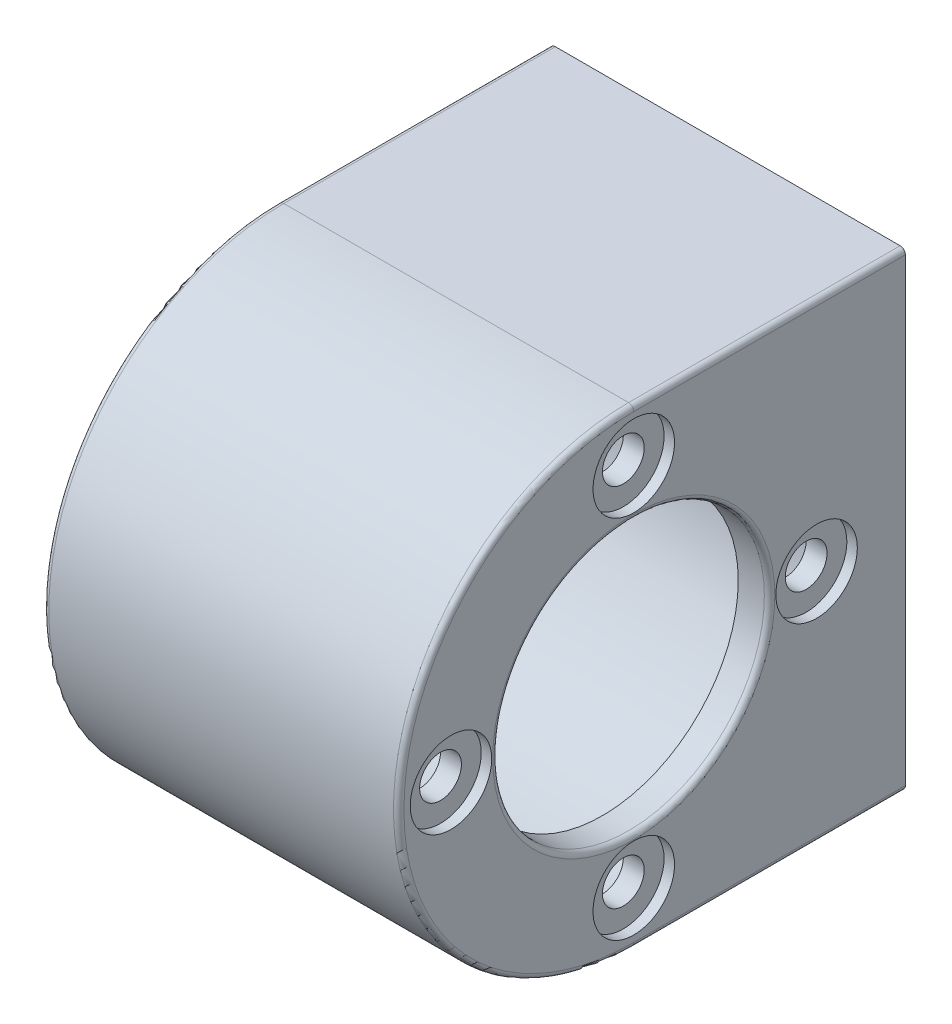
ISO-10303-21;
HEADER;
FILE_DESCRIPTION(('STEP AP214'),'2;1');
FILE_NAME('part.step','',(''),(''),'','','');
FILE_SCHEMA(('AUTOMOTIVE_DESIGN { 1 0 10303 214 1 1 1 1 }'));
ENDSEC;
DATA;
#1=APPLICATION_CONTEXT('core data for automotive mechanical design processes');
#2=APPLICATION_PROTOCOL_DEFINITION('international standard','automotive_design',2000,#1);
#3=PRODUCT_CONTEXT('',#1,'mechanical');
#4=PRODUCT('Part','Part','',(#3));
#5=PRODUCT_RELATED_PRODUCT_CATEGORY('part','',(#4));
#6=PRODUCT_DEFINITION_FORMATION('','',#4);
#7=PRODUCT_DEFINITION_CONTEXT('part definition',#1,'design');
#8=PRODUCT_DEFINITION('design','',#6,#7);
#9=PRODUCT_DEFINITION_SHAPE('','',#8);
#10=(LENGTH_UNIT() NAMED_UNIT(*) SI_UNIT(.MILLI.,.METRE.));
#11=(NAMED_UNIT(*) PLANE_ANGLE_UNIT() SI_UNIT($,.RADIAN.));
#12=(NAMED_UNIT(*) SI_UNIT($,.STERADIAN.) SOLID_ANGLE_UNIT());
#13=UNCERTAINTY_MEASURE_WITH_UNIT(LENGTH_MEASURE(1.E-05),#10,'distance_accuracy_value','');
#14=(GEOMETRIC_REPRESENTATION_CONTEXT(3) GLOBAL_UNCERTAINTY_ASSIGNED_CONTEXT((#13)) GLOBAL_UNIT_ASSIGNED_CONTEXT((#10,
#11,#12)) REPRESENTATION_CONTEXT('',''));
#15=CARTESIAN_POINT('',(0.,0.,0.));
#16=DIRECTION('',(0.,0.,1.));
#17=DIRECTION('',(1.,0.,0.));
#18=AXIS2_PLACEMENT_3D('',#15,#16,#17);
#19=CARTESIAN_POINT('',(14.0836830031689,65.,26.));
#20=DIRECTION('',(1.,0.,0.));
#21=DIRECTION('',(0.,0.,-1.));
#22=AXIS2_PLACEMENT_3D('',#19,#20,#21);
#23=PLANE('',#22);
#24=CARTESIAN_POINT('',(14.0836830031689,65.0117014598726,8.5));
#25=DIRECTION('',(-1.,0.,0.));
#26=DIRECTION('',(0.,0.,-1.));
#27=AXIS2_PLACEMENT_3D('',#24,#25,#26);
#28=CIRCLE('',#27,3.9);
#29=CARTESIAN_POINT('',(14.0836830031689,65.0117014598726,4.6));
#30=VERTEX_POINT('',#29);
#31=EDGE_CURVE('E469',#30,#30,#28,.T.);
#32=ORIENTED_EDGE('',*,*,#31,.T.);
#33=EDGE_LOOP('',(#32));
#34=FACE_BOUND('',#33,.T.);
#35=CARTESIAN_POINT('',(14.0836830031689,47.5117014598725,26.));
#36=DIRECTION('',(-1.,0.,0.));
#37=DIRECTION('',(0.,0.,-1.));
#38=AXIS2_PLACEMENT_3D('',#35,#36,#37);
#39=CIRCLE('',#38,3.9);
#40=CARTESIAN_POINT('',(14.0836830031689,47.5117014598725,22.1));
#41=VERTEX_POINT('',#40);
#42=EDGE_CURVE('E378',#41,#41,#39,.T.);
#43=ORIENTED_EDGE('',*,*,#42,.T.);
#44=EDGE_LOOP('',(#43));
#45=FACE_BOUND('',#44,.T.);
#46=CARTESIAN_POINT('',(14.0836830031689,65.0117014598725,43.5));
#47=DIRECTION('',(-1.,0.,0.));
#48=DIRECTION('',(0.,0.,-1.));
#49=AXIS2_PLACEMENT_3D('',#46,#47,#48);
#50=CIRCLE('',#49,3.9);
#51=CARTESIAN_POINT('',(14.0836830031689,65.0117014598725,39.6));
#52=VERTEX_POINT('',#51);
#53=EDGE_CURVE('E620',#52,#52,#50,.T.);
#54=ORIENTED_EDGE('',*,*,#53,.T.);
#55=EDGE_LOOP('',(#54));
#56=FACE_BOUND('',#55,.T.);
#57=CARTESIAN_POINT('',(14.0836830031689,82.5117014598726,26.0000000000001));
#58=DIRECTION('',(-1.,0.,0.));
#59=DIRECTION('',(0.,0.,-1.));
#60=AXIS2_PLACEMENT_3D('',#57,#58,#59);
#61=CIRCLE('',#60,3.9);
#62=CARTESIAN_POINT('',(14.0836830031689,82.5117014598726,22.1000000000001));
#63=VERTEX_POINT('',#62);
#64=EDGE_CURVE('E626',#63,#63,#61,.T.);
#65=ORIENTED_EDGE('',*,*,#64,.T.);
#66=EDGE_LOOP('',(#65));
#67=FACE_BOUND('',#66,.T.);
#68=CARTESIAN_POINT('',(14.0836830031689,65.,26.));
#69=DIRECTION('',(-1.,0.,0.));
#70=DIRECTION('',(0.,0.,-1.));
#71=AXIS2_PLACEMENT_3D('',#68,#69,#70);
#72=CIRCLE('',#71,13.5);
#73=CARTESIAN_POINT('',(14.0836830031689,65.,12.5));
#74=VERTEX_POINT('',#73);
#75=EDGE_CURVE('E348',#74,#74,#72,.F.);
#76=ORIENTED_EDGE('',*,*,#75,.F.);
#77=EDGE_LOOP('',(#76));
#78=FACE_BOUND('',#77,.T.);
#79=CARTESIAN_POINT('',(14.0836830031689,65.,26.));
#80=DIRECTION('',(-1.,0.,0.));
#81=DIRECTION('',(0.,0.,-1.));
#82=AXIS2_PLACEMENT_3D('',#79,#80,#81);
#83=CIRCLE('',#82,22.);
#84=CARTESIAN_POINT('',(14.0836830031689,51.25,43.1737444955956));
#85=VERTEX_POINT('',#84);
#86=CARTESIAN_POINT('',(14.0836830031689,87.,26.));
#87=VERTEX_POINT('',#86);
#88=EDGE_CURVE('E353',#85,#87,#83,.T.);
#89=ORIENTED_EDGE('',*,*,#88,.F.);
#90=CARTESIAN_POINT('',(14.0836830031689,65.,26.));
#91=DIRECTION('',(1.,0.,0.));
#92=DIRECTION('',(0.,0.,-1.));
#93=AXIS2_PLACEMENT_3D('',#90,#91,#92);
#94=CIRCLE('',#93,22.);
#95=CARTESIAN_POINT('',(14.0836830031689,43.,26.));
#96=VERTEX_POINT('',#95);
#97=EDGE_CURVE('E44',#85,#96,#94,.T.);
#98=ORIENTED_EDGE('',*,*,#97,.T.);
#99=DIRECTION('',(0.,0.,1.));
#100=VECTOR('',#99,1.);
#101=CARTESIAN_POINT('',(14.0836830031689,43.,26.));
#102=LINE('',#101,#100);
#103=CARTESIAN_POINT('',(14.0836830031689,43.,0.));
#104=VERTEX_POINT('',#103);
#105=EDGE_CURVE('E346',#104,#96,#102,.T.);
#106=ORIENTED_EDGE('',*,*,#105,.F.);
#107=DIRECTION('',(0.,1.,0.));
#108=VECTOR('',#107,1.);
#109=CARTESIAN_POINT('',(14.0836830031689,57.5,0.));
#110=LINE('',#109,#108);
#111=CARTESIAN_POINT('',(14.0836830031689,87.,0.));
#112=VERTEX_POINT('',#111);
#113=EDGE_CURVE('E548',#104,#112,#110,.T.);
#114=ORIENTED_EDGE('',*,*,#113,.T.);
#115=DIRECTION('',(0.,0.,-1.));
#116=VECTOR('',#115,1.);
#117=CARTESIAN_POINT('',(14.0836830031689,87.,26.));
#118=LINE('',#117,#116);
#119=EDGE_CURVE('E351',#87,#112,#118,.T.);
#120=ORIENTED_EDGE('',*,*,#119,.F.);
#121=EDGE_LOOP('',(#89,#98,#106,#114,#120));
#122=FACE_BOUND('',#121,.T.);
#123=ADVANCED_FACE('F36',(#34,#45,#56,#67,#78,#122),#23,.T.);
#124=CARTESIAN_POINT('',(-19.9163169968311,42.5,26.));
#125=DIRECTION('',(0.,-1.,0.));
#126=DIRECTION('',(0.,0.,1.));
#127=AXIS2_PLACEMENT_3D('',#124,#125,#126);
#128=PLANE('',#127);
#129=CARTESIAN_POINT('',(7.08368300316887,42.5,16.5));
#130=DIRECTION('',(0.,1.,0.));
#131=DIRECTION('',(0.,0.,1.));
#132=AXIS2_PLACEMENT_3D('',#129,#130,#131);
#133=CIRCLE('',#132,2.5);
#134=CARTESIAN_POINT('',(7.08368300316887,42.5,19.));
#135=VERTEX_POINT('',#134);
#136=CARTESIAN_POINT('',(9.58368300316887,42.5,16.5));
#137=VERTEX_POINT('',#136);
#138=EDGE_CURVE('E286',#135,#137,#133,.T.);
#139=ORIENTED_EDGE('',*,*,#138,.T.);
#140=DIRECTION('',(0.,0.,-1.));
#141=VECTOR('',#140,1.);
#142=CARTESIAN_POINT('',(9.58368300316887,42.5,16.5));
#143=LINE('',#142,#141);
#144=CARTESIAN_POINT('',(9.58368300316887,42.5,7.50000000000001));
#145=VERTEX_POINT('',#144);
#146=EDGE_CURVE('E664',#137,#145,#143,.T.);
#147=ORIENTED_EDGE('',*,*,#146,.T.);
#148=CARTESIAN_POINT('',(7.08368300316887,42.5,7.50000000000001));
#149=DIRECTION('',(0.,1.,0.));
#150=DIRECTION('',(0.,0.,-1.));
#151=AXIS2_PLACEMENT_3D('',#148,#149,#150);
#152=CIRCLE('',#151,2.5);
#153=CARTESIAN_POINT('',(7.08368300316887,42.5,5.00000000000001));
#154=VERTEX_POINT('',#153);
#155=EDGE_CURVE('E661',#145,#154,#152,.T.);
#156=ORIENTED_EDGE('',*,*,#155,.T.);
#157=DIRECTION('',(-1.,0.,0.));
#158=VECTOR('',#157,1.);
#159=CARTESIAN_POINT('',(-12.9163169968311,42.5,5.00000000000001));
#160=LINE('',#159,#158);
#161=CARTESIAN_POINT('',(-12.9163169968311,42.5,5.00000000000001));
#162=VERTEX_POINT('',#161);
#163=EDGE_CURVE('E658',#154,#162,#160,.T.);
#164=ORIENTED_EDGE('',*,*,#163,.T.);
#165=CARTESIAN_POINT('',(-12.9163169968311,42.5,7.50000000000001));
#166=DIRECTION('',(0.,1.,0.));
#167=DIRECTION('',(0.,0.,-1.));
#168=AXIS2_PLACEMENT_3D('',#165,#166,#167);
#169=CIRCLE('',#168,2.5);
#170=CARTESIAN_POINT('',(-15.4163169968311,42.5,7.50000000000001));
#171=VERTEX_POINT('',#170);
#172=EDGE_CURVE('E655',#162,#171,#169,.T.);
#173=ORIENTED_EDGE('',*,*,#172,.T.);
#174=DIRECTION('',(0.,0.,1.));
#175=VECTOR('',#174,1.);
#176=CARTESIAN_POINT('',(-15.4163169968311,42.5,16.5));
#177=LINE('',#176,#175);
#178=CARTESIAN_POINT('',(-15.4163169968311,42.5,16.5));
#179=VERTEX_POINT('',#178);
#180=EDGE_CURVE('E652',#171,#179,#177,.T.);
#181=ORIENTED_EDGE('',*,*,#180,.T.);
#182=CARTESIAN_POINT('',(-12.9163169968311,42.5,16.5));
#183=DIRECTION('',(0.,1.,0.));
#184=DIRECTION('',(0.,0.,-1.));
#185=AXIS2_PLACEMENT_3D('',#182,#183,#184);
#186=CIRCLE('',#185,2.5);
#187=CARTESIAN_POINT('',(-12.9163169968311,42.5,19.));
#188=VERTEX_POINT('',#187);
#189=EDGE_CURVE('E649',#179,#188,#186,.T.);
#190=ORIENTED_EDGE('',*,*,#189,.T.);
#191=DIRECTION('',(1.,0.,0.));
#192=VECTOR('',#191,1.);
#193=CARTESIAN_POINT('',(-12.9163169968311,42.5,19.));
#194=LINE('',#193,#192);
#195=EDGE_CURVE('E645',#188,#135,#194,.T.);
#196=ORIENTED_EDGE('',*,*,#195,.T.);
#197=EDGE_LOOP('',(#139,#147,#156,#164,#173,#181,#190,#196));
#198=FACE_BOUND('',#197,.T.);
#199=DIRECTION('',(0.,0.,1.));
#200=VECTOR('',#199,1.);
#201=CARTESIAN_POINT('',(13.5836830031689,42.5,26.));
#202=LINE('',#201,#200);
#203=CARTESIAN_POINT('',(13.5836830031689,42.5,26.));
#204=VERTEX_POINT('',#203);
#205=CARTESIAN_POINT('',(13.5836830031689,42.5,0.));
#206=VERTEX_POINT('',#205);
#207=EDGE_CURVE('E285',#204,#206,#202,.F.);
#208=ORIENTED_EDGE('',*,*,#207,.F.);
#209=DIRECTION('',(1.,0.,0.));
#210=VECTOR('',#209,1.);
#211=CARTESIAN_POINT('',(-27.9163169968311,42.5,26.));
#212=LINE('',#211,#210);
#213=CARTESIAN_POINT('',(-19.4163169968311,42.5,26.));
#214=VERTEX_POINT('',#213);
#215=EDGE_CURVE('E271',#214,#204,#212,.T.);
#216=ORIENTED_EDGE('',*,*,#215,.F.);
#217=DIRECTION('',(0.,0.,1.));
#218=VECTOR('',#217,1.);
#219=CARTESIAN_POINT('',(-19.4163169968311,42.5,48.5));
#220=LINE('',#219,#218);
#221=CARTESIAN_POINT('',(-19.4163169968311,42.5,0.));
#222=VERTEX_POINT('',#221);
#223=EDGE_CURVE('E283',#222,#214,#220,.T.);
#224=ORIENTED_EDGE('',*,*,#223,.F.);
#225=DIRECTION('',(1.,0.,0.));
#226=VECTOR('',#225,1.);
#227=CARTESIAN_POINT('',(-19.9163169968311,42.5,0.));
#228=LINE('',#227,#226);
#229=EDGE_CURVE('E603',#222,#206,#228,.T.);
#230=ORIENTED_EDGE('',*,*,#229,.T.);
#231=EDGE_LOOP('',(#208,#216,#224,#230));
#232=FACE_BOUND('',#231,.T.);
#233=ADVANCED_FACE('F281',(#198,#232),#128,.T.);
#234=CARTESIAN_POINT('',(-19.9163169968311,65.,26.));
#235=DIRECTION('',(1.,0.,0.));
#236=DIRECTION('',(0.,0.,-1.));
#237=AXIS2_PLACEMENT_3D('',#234,#235,#236);
#238=PLANE('',#237);
#239=CARTESIAN_POINT('',(-19.9163169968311,84.5,12.0089314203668));
#240=DIRECTION('',(-1.,0.,0.));
#241=DIRECTION('',(0.,0.,-1.));
#242=AXIS2_PLACEMENT_3D('',#239,#240,#241);
#243=CIRCLE('',#242,1.99999999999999);
#244=CARTESIAN_POINT('',(-19.9163169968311,82.875,13.1748538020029));
#245=VERTEX_POINT('',#244);
#246=CARTESIAN_POINT('',(-19.9163169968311,86.5,12.0089314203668));
#247=VERTEX_POINT('',#246);
#248=EDGE_CURVE('E429',#245,#247,#243,.T.);
#249=ORIENTED_EDGE('',*,*,#248,.F.);
#250=CARTESIAN_POINT('',(-19.9163169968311,65.,26.));
#251=DIRECTION('',(-1.,0.,0.));
#252=DIRECTION('',(0.,0.,-1.));
#253=AXIS2_PLACEMENT_3D('',#250,#251,#252);
#254=CIRCLE('',#253,22.);
#255=CARTESIAN_POINT('',(-19.9163169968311,76.4399853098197,7.20833333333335));
#256=VERTEX_POINT('',#255);
#257=EDGE_CURVE('E435',#256,#245,#254,.F.);
#258=ORIENTED_EDGE('',*,*,#257,.F.);
#259=CARTESIAN_POINT('',(-19.9163169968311,77.4799839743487,5.50000000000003));
#260=DIRECTION('',(-1.,0.,0.));
#261=DIRECTION('',(0.,0.,-1.));
#262=AXIS2_PLACEMENT_3D('',#259,#260,#261);
#263=CIRCLE('',#262,1.99999999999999);
#264=CARTESIAN_POINT('',(-19.9163169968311,77.4799839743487,3.50000000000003));
#265=VERTEX_POINT('',#264);
#266=EDGE_CURVE('E438',#265,#256,#263,.T.);
#267=ORIENTED_EDGE('',*,*,#266,.F.);
#268=DIRECTION('',(0.,-1.,0.));
#269=VECTOR('',#268,1.);
#270=CARTESIAN_POINT('',(-19.9163169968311,77.4799839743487,3.50000000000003));
#271=LINE('',#270,#269);
#272=CARTESIAN_POINT('',(-19.9163169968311,83.5,3.50000000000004));
#273=VERTEX_POINT('',#272);
#274=EDGE_CURVE('E432',#273,#265,#271,.T.);
#275=ORIENTED_EDGE('',*,*,#274,.F.);
#276=CARTESIAN_POINT('',(-19.9163169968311,83.5,6.50000000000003));
#277=DIRECTION('',(-1.,0.,0.));
#278=DIRECTION('',(0.,0.,-1.));
#279=AXIS2_PLACEMENT_3D('',#276,#277,#278);
#280=CIRCLE('',#279,2.99999999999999);
#281=CARTESIAN_POINT('',(-19.9163169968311,86.5,6.50000000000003));
#282=VERTEX_POINT('',#281);
#283=EDGE_CURVE('E426',#282,#273,#280,.T.);
#284=ORIENTED_EDGE('',*,*,#283,.F.);
#285=DIRECTION('',(0.,0.,-1.));
#286=VECTOR('',#285,1.);
#287=CARTESIAN_POINT('',(-19.9163169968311,86.5,6.50000000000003));
#288=LINE('',#287,#286);
#289=EDGE_CURVE('E423',#247,#282,#288,.T.);
#290=ORIENTED_EDGE('',*,*,#289,.F.);
#291=EDGE_LOOP('',(#249,#258,#267,#275,#284,#290));
#292=FACE_BOUND('',#291,.T.);
#293=DIRECTION('',(0.,-1.,0.));
#294=VECTOR('',#293,1.);
#295=CARTESIAN_POINT('',(-19.9163169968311,46.5,3.5));
#296=LINE('',#295,#294);
#297=CARTESIAN_POINT('',(-19.9163169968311,52.5200160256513,3.50000000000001));
#298=VERTEX_POINT('',#297);
#299=CARTESIAN_POINT('',(-19.9163169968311,46.5,3.5));
#300=VERTEX_POINT('',#299);
#301=EDGE_CURVE('E444',#298,#300,#296,.T.);
#302=ORIENTED_EDGE('',*,*,#301,.F.);
#303=CARTESIAN_POINT('',(-19.9163169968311,52.5200160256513,5.50000000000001));
#304=DIRECTION('',(-1.,0.,0.));
#305=DIRECTION('',(0.,0.,-1.));
#306=AXIS2_PLACEMENT_3D('',#303,#304,#305);
#307=CIRCLE('',#306,2.);
#308=CARTESIAN_POINT('',(-19.9163169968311,53.5600146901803,7.20833333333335));
#309=VERTEX_POINT('',#308);
#310=EDGE_CURVE('E450',#309,#298,#307,.T.);
#311=ORIENTED_EDGE('',*,*,#310,.F.);
#312=CARTESIAN_POINT('',(-19.9163169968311,65.,26.));
#313=DIRECTION('',(-1.,0.,0.));
#314=DIRECTION('',(0.,0.,-1.));
#315=AXIS2_PLACEMENT_3D('',#312,#313,#314);
#316=CIRCLE('',#315,22.);
#317=CARTESIAN_POINT('',(-19.9163169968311,47.125,13.1748538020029));
#318=VERTEX_POINT('',#317);
#319=EDGE_CURVE('E456',#318,#309,#316,.F.);
#320=ORIENTED_EDGE('',*,*,#319,.F.);
#321=CARTESIAN_POINT('',(-19.9163169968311,45.5,12.0089314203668));
#322=DIRECTION('',(-1.,0.,0.));
#323=DIRECTION('',(0.,0.,-1.));
#324=AXIS2_PLACEMENT_3D('',#321,#322,#323);
#325=CIRCLE('',#324,2.00000000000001);
#326=CARTESIAN_POINT('',(-19.9163169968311,43.5,12.0089314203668));
#327=VERTEX_POINT('',#326);
#328=EDGE_CURVE('E453',#327,#318,#325,.T.);
#329=ORIENTED_EDGE('',*,*,#328,.F.);
#330=DIRECTION('',(0.,0.,1.));
#331=VECTOR('',#330,1.);
#332=CARTESIAN_POINT('',(-19.9163169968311,43.5,12.0089314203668));
#333=LINE('',#332,#331);
#334=CARTESIAN_POINT('',(-19.9163169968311,43.5,6.50000000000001));
#335=VERTEX_POINT('',#334);
#336=EDGE_CURVE('E447',#335,#327,#333,.T.);
#337=ORIENTED_EDGE('',*,*,#336,.F.);
#338=CARTESIAN_POINT('',(-19.9163169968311,46.5,6.50000000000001));
#339=DIRECTION('',(-1.,0.,0.));
#340=DIRECTION('',(0.,0.,-1.));
#341=AXIS2_PLACEMENT_3D('',#338,#339,#340);
#342=CIRCLE('',#341,3.);
#343=EDGE_CURVE('E441',#300,#335,#342,.T.);
#344=ORIENTED_EDGE('',*,*,#343,.F.);
#345=EDGE_LOOP('',(#302,#311,#320,#329,#337,#344));
#346=FACE_BOUND('',#345,.T.);
#347=CARTESIAN_POINT('',(-19.9163169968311,65.,26.));
#348=DIRECTION('',(-1.,0.,0.));
#349=DIRECTION('',(0.,0.,-1.));
#350=AXIS2_PLACEMENT_3D('',#347,#348,#349);
#351=CIRCLE('',#350,21.5);
#352=CARTESIAN_POINT('',(-19.9163169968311,65.,4.49999999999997));
#353=VERTEX_POINT('',#352);
#354=EDGE_CURVE('E459',#353,#353,#351,.T.);
#355=ORIENTED_EDGE('',*,*,#354,.F.);
#356=EDGE_LOOP('',(#355));
#357=FACE_BOUND('',#356,.T.);
#358=DIRECTION('',(0.,0.,1.));
#359=VECTOR('',#358,1.);
#360=CARTESIAN_POINT('',(-19.9163169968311,43.,0.));
#361=LINE('',#360,#359);
#362=CARTESIAN_POINT('',(-19.9163169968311,43.,26.));
#363=VERTEX_POINT('',#362);
#364=CARTESIAN_POINT('',(-19.9163169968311,43.,0.));
#365=VERTEX_POINT('',#364);
#366=EDGE_CURVE('E361',#363,#365,#361,.F.);
#367=ORIENTED_EDGE('',*,*,#366,.F.);
#368=CARTESIAN_POINT('',(-19.9163169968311,65.,26.));
#369=DIRECTION('',(1.,0.,0.));
#370=DIRECTION('',(0.,0.,-1.));
#371=AXIS2_PLACEMENT_3D('',#368,#369,#370);
#372=CIRCLE('',#371,22.);
#373=CARTESIAN_POINT('',(-19.9163169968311,51.25,43.1737444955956));
#374=VERTEX_POINT('',#373);
#375=EDGE_CURVE('E11',#363,#374,#372,.F.);
#376=ORIENTED_EDGE('',*,*,#375,.T.);
#377=CARTESIAN_POINT('',(-19.9163169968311,65.,26.));
#378=DIRECTION('',(-1.,0.,0.));
#379=DIRECTION('',(0.,0.,-1.));
#380=AXIS2_PLACEMENT_3D('',#377,#378,#379);
#381=CIRCLE('',#380,22.);
#382=CARTESIAN_POINT('',(-19.9163169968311,87.,26.));
#383=VERTEX_POINT('',#382);
#384=EDGE_CURVE('E316',#383,#374,#381,.F.);
#385=ORIENTED_EDGE('',*,*,#384,.F.);
#386=DIRECTION('',(0.,0.,-1.));
#387=VECTOR('',#386,1.);
#388=CARTESIAN_POINT('',(-19.9163169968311,87.,26.));
#389=LINE('',#388,#387);
#390=CARTESIAN_POINT('',(-19.9163169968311,87.,0.));
#391=VERTEX_POINT('',#390);
#392=EDGE_CURVE('E358',#391,#383,#389,.F.);
#393=ORIENTED_EDGE('',*,*,#392,.F.);
#394=DIRECTION('',(0.,-1.,0.));
#395=VECTOR('',#394,1.);
#396=CARTESIAN_POINT('',(-19.9163169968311,86.,0.));
#397=LINE('',#396,#395);
#398=EDGE_CURVE('E480',#391,#365,#397,.T.);
#399=ORIENTED_EDGE('',*,*,#398,.T.);
#400=EDGE_LOOP('',(#367,#376,#385,#393,#399));
#401=FACE_BOUND('',#400,.T.);
#402=ADVANCED_FACE('F739',(#292,#346,#357,#401),#238,.F.);
#403=CARTESIAN_POINT('',(-19.9163169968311,65.,26.));
#404=DIRECTION('',(1.,0.,0.));
#405=DIRECTION('',(0.,0.,-1.));
#406=AXIS2_PLACEMENT_3D('',#403,#404,#405);
#407=CYLINDRICAL_SURFACE('',#406,22.5);
#408=ORIENTED_EDGE('',*,*,#215,.T.);
#409=CARTESIAN_POINT('',(13.5836830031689,65.,26.));
#410=DIRECTION('',(1.,0.,0.));
#411=DIRECTION('',(0.,0.,-1.));
#412=AXIS2_PLACEMENT_3D('',#409,#410,#411);
#413=CIRCLE('',#412,22.5);
#414=CARTESIAN_POINT('',(13.5836830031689,50.9375,43.5640568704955));
#415=VERTEX_POINT('',#414);
#416=EDGE_CURVE('E275',#204,#415,#413,.F.);
#417=ORIENTED_EDGE('',*,*,#416,.T.);
#418=CARTESIAN_POINT('',(13.5836830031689,65.,26.));
#419=DIRECTION('',(-1.,0.,0.));
#420=DIRECTION('',(0.,0.,-1.));
#421=AXIS2_PLACEMENT_3D('',#418,#419,#420);
#422=CIRCLE('',#421,22.5);
#423=CARTESIAN_POINT('',(13.5836830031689,87.5,26.));
#424=VERTEX_POINT('',#423);
#425=EDGE_CURVE('E305',#424,#415,#422,.F.);
#426=ORIENTED_EDGE('',*,*,#425,.F.);
#427=DIRECTION('',(1.,0.,0.));
#428=VECTOR('',#427,1.);
#429=CARTESIAN_POINT('',(-19.9163169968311,87.5,26.));
#430=LINE('',#429,#428);
#431=CARTESIAN_POINT('',(-19.4163169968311,87.5,26.));
#432=VERTEX_POINT('',#431);
#433=EDGE_CURVE('E605',#432,#424,#430,.T.);
#434=ORIENTED_EDGE('',*,*,#433,.F.);
#435=CARTESIAN_POINT('',(-19.4163169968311,65.,26.));
#436=DIRECTION('',(-1.,0.,0.));
#437=DIRECTION('',(0.,0.,-1.));
#438=AXIS2_PLACEMENT_3D('',#435,#436,#437);
#439=CIRCLE('',#438,22.5);
#440=CARTESIAN_POINT('',(-19.4163169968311,50.9375,43.5640568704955));
#441=VERTEX_POINT('',#440);
#442=EDGE_CURVE('E274',#441,#432,#439,.T.);
#443=ORIENTED_EDGE('',*,*,#442,.F.);
#444=CARTESIAN_POINT('',(-19.4163169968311,65.,26.));
#445=DIRECTION('',(1.,0.,0.));
#446=DIRECTION('',(0.,0.,-1.));
#447=AXIS2_PLACEMENT_3D('',#444,#445,#446);
#448=CIRCLE('',#447,22.5);
#449=EDGE_CURVE('E268',#441,#214,#448,.T.);
#450=ORIENTED_EDGE('',*,*,#449,.T.);
#451=EDGE_LOOP('',(#408,#417,#426,#434,#443,#450));
#452=FACE_BOUND('',#451,.T.);
#453=ADVANCED_FACE('F270',(#452),#407,.T.);
#454=CARTESIAN_POINT('',(10.0836830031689,47.5117014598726,26.));
#455=DIRECTION('',(1.,0.,0.));
#456=DIRECTION('',(0.,0.,-1.));
#457=AXIS2_PLACEMENT_3D('',#454,#455,#456);
#458=CYLINDRICAL_SURFACE('',#457,2.);
#459=CARTESIAN_POINT('',(11.0836830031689,47.5117014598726,26.));
#460=DIRECTION('',(-1.,0.,0.));
#461=DIRECTION('',(0.,0.,-1.));
#462=AXIS2_PLACEMENT_3D('',#459,#460,#461);
#463=CIRCLE('',#462,2.);
#464=CARTESIAN_POINT('',(11.0836830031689,47.5117014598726,24.));
#465=VERTEX_POINT('',#464);
#466=EDGE_CURVE('E562',#465,#465,#463,.T.);
#467=ORIENTED_EDGE('',*,*,#466,.T.);
#468=EDGE_LOOP('',(#467));
#469=FACE_BOUND('',#468,.T.);
#470=CARTESIAN_POINT('',(13.0836830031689,47.5117014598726,26.));
#471=DIRECTION('',(-1.,0.,0.));
#472=DIRECTION('',(0.,0.,-1.));
#473=AXIS2_PLACEMENT_3D('',#470,#471,#472);
#474=CIRCLE('',#473,2.);
#475=CARTESIAN_POINT('',(13.0836830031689,47.5117014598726,24.));
#476=VERTEX_POINT('',#475);
#477=EDGE_CURVE('E466',#476,#476,#474,.F.);
#478=ORIENTED_EDGE('',*,*,#477,.T.);
#479=EDGE_LOOP('',(#478));
#480=FACE_BOUND('',#479,.T.);
#481=ADVANCED_FACE('F971',(#469,#480),#458,.F.);
#482=CARTESIAN_POINT('',(10.0836830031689,82.5117014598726,26.));
#483=DIRECTION('',(1.,0.,0.));
#484=DIRECTION('',(0.,0.,-1.));
#485=AXIS2_PLACEMENT_3D('',#482,#483,#484);
#486=CYLINDRICAL_SURFACE('',#485,2.00000000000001);
#487=CARTESIAN_POINT('',(11.0836830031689,82.5117014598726,26.));
#488=DIRECTION('',(-1.,0.,0.));
#489=DIRECTION('',(0.,0.,-1.));
#490=AXIS2_PLACEMENT_3D('',#487,#488,#489);
#491=CIRCLE('',#490,2.00000000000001);
#492=CARTESIAN_POINT('',(11.0836830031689,82.5117014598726,24.));
#493=VERTEX_POINT('',#492);
#494=EDGE_CURVE('E568',#493,#493,#491,.T.);
#495=ORIENTED_EDGE('',*,*,#494,.T.);
#496=EDGE_LOOP('',(#495));
#497=FACE_BOUND('',#496,.T.);
#498=CARTESIAN_POINT('',(13.0836830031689,82.5117014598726,26.));
#499=DIRECTION('',(-1.,0.,0.));
#500=DIRECTION('',(0.,0.,-1.));
#501=AXIS2_PLACEMENT_3D('',#498,#499,#500);
#502=CIRCLE('',#501,2.00000000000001);
#503=CARTESIAN_POINT('',(13.0836830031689,82.5117014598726,24.));
#504=VERTEX_POINT('',#503);
#505=EDGE_CURVE('E470',#504,#504,#502,.F.);
#506=ORIENTED_EDGE('',*,*,#505,.T.);
#507=EDGE_LOOP('',(#506));
#508=FACE_BOUND('',#507,.T.);
#509=ADVANCED_FACE('F1225',(#497,#508),#486,.F.);
#510=CARTESIAN_POINT('',(10.0836830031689,65.0117014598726,43.5));
#511=DIRECTION('',(1.,0.,0.));
#512=DIRECTION('',(0.,0.,-1.));
#513=AXIS2_PLACEMENT_3D('',#510,#511,#512);
#514=CYLINDRICAL_SURFACE('',#513,2.00000000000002);
#515=CARTESIAN_POINT('',(11.0836830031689,65.0117014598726,43.5));
#516=DIRECTION('',(-1.,0.,0.));
#517=DIRECTION('',(0.,0.,-1.));
#518=AXIS2_PLACEMENT_3D('',#515,#516,#517);
#519=CIRCLE('',#518,2.00000000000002);
#520=CARTESIAN_POINT('',(11.0836830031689,65.0117014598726,41.5));
#521=VERTEX_POINT('',#520);
#522=EDGE_CURVE('E565',#521,#521,#519,.T.);
#523=ORIENTED_EDGE('',*,*,#522,.T.);
#524=EDGE_LOOP('',(#523));
#525=FACE_BOUND('',#524,.T.);
#526=CARTESIAN_POINT('',(13.0836830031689,65.0117014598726,43.5));
#527=DIRECTION('',(-1.,0.,0.));
#528=DIRECTION('',(0.,0.,-1.));
#529=AXIS2_PLACEMENT_3D('',#526,#527,#528);
#530=CIRCLE('',#529,2.00000000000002);
#531=CARTESIAN_POINT('',(13.0836830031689,65.0117014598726,41.5));
#532=VERTEX_POINT('',#531);
#533=EDGE_CURVE('E473',#532,#532,#530,.F.);
#534=ORIENTED_EDGE('',*,*,#533,.T.);
#535=EDGE_LOOP('',(#534));
#536=FACE_BOUND('',#535,.T.);
#537=ADVANCED_FACE('F1221',(#525,#536),#514,.F.);
#538=CARTESIAN_POINT('',(10.0836830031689,65.0117014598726,8.5));
#539=DIRECTION('',(1.,0.,0.));
#540=DIRECTION('',(0.,0.,-1.));
#541=AXIS2_PLACEMENT_3D('',#538,#539,#540);
#542=CYLINDRICAL_SURFACE('',#541,2.);
#543=CARTESIAN_POINT('',(11.0836830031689,65.0117014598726,8.5));
#544=DIRECTION('',(-1.,0.,0.));
#545=DIRECTION('',(0.,0.,-1.));
#546=AXIS2_PLACEMENT_3D('',#543,#544,#545);
#547=CIRCLE('',#546,2.);
#548=CARTESIAN_POINT('',(11.0836830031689,65.0117014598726,6.5));
#549=VERTEX_POINT('',#548);
#550=EDGE_CURVE('E571',#549,#549,#547,.T.);
#551=ORIENTED_EDGE('',*,*,#550,.T.);
#552=EDGE_LOOP('',(#551));
#553=FACE_BOUND('',#552,.T.);
#554=CARTESIAN_POINT('',(13.0836830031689,65.0117014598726,8.5));
#555=DIRECTION('',(-1.,0.,0.));
#556=DIRECTION('',(0.,0.,-1.));
#557=AXIS2_PLACEMENT_3D('',#554,#555,#556);
#558=CIRCLE('',#557,2.);
#559=CARTESIAN_POINT('',(13.0836830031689,65.0117014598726,6.5));
#560=VERTEX_POINT('',#559);
#561=EDGE_CURVE('E477',#560,#560,#558,.F.);
#562=ORIENTED_EDGE('',*,*,#561,.T.);
#563=EDGE_LOOP('',(#562));
#564=FACE_BOUND('',#563,.T.);
#565=ADVANCED_FACE('F1224',(#553,#564),#542,.F.);
#566=CARTESIAN_POINT('',(0.,65.,4.00000000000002));
#567=DIRECTION('',(0.,0.,1.));
#568=DIRECTION('',(1.,0.,0.));
#569=AXIS2_PLACEMENT_3D('',#566,#567,#568);
#570=PLANE('',#569);
#571=DIRECTION('',(-1.,0.,0.));
#572=VECTOR('',#571,1.);
#573=CARTESIAN_POINT('',(-19.9163169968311,77.4799839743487,4.00000000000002));
#574=LINE('',#573,#572);
#575=CARTESIAN_POINT('',(11.0836830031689,77.4799839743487,4.));
#576=VERTEX_POINT('',#575);
#577=CARTESIAN_POINT('',(-19.4163169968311,77.4799839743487,4.00000000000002));
#578=VERTEX_POINT('',#577);
#579=EDGE_CURVE('E500',#576,#578,#574,.T.);
#580=ORIENTED_EDGE('',*,*,#579,.F.);
#581=DIRECTION('',(0.,-1.,0.));
#582=VECTOR('',#581,1.);
#583=CARTESIAN_POINT('',(11.0836830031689,44.,3.99999999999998));
#584=LINE('',#583,#582);
#585=CARTESIAN_POINT('',(11.0836830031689,83.5,4.));
#586=VERTEX_POINT('',#585);
#587=EDGE_CURVE('E555',#586,#576,#584,.T.);
#588=ORIENTED_EDGE('',*,*,#587,.F.);
#589=DIRECTION('',(-1.,0.,0.));
#590=VECTOR('',#589,1.);
#591=CARTESIAN_POINT('',(11.0836830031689,83.5,4.00000000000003));
#592=LINE('',#591,#590);
#593=CARTESIAN_POINT('',(-19.4163169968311,83.5,4.00000000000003));
#594=VERTEX_POINT('',#593);
#595=EDGE_CURVE('E523',#594,#586,#592,.F.);
#596=ORIENTED_EDGE('',*,*,#595,.F.);
#597=DIRECTION('',(0.,1.,0.));
#598=VECTOR('',#597,1.);
#599=CARTESIAN_POINT('',(-19.4163169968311,83.5,4.00000000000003));
#600=LINE('',#599,#598);
#601=EDGE_CURVE('E414',#578,#594,#600,.T.);
#602=ORIENTED_EDGE('',*,*,#601,.F.);
#603=EDGE_LOOP('',(#580,#588,#596,#602));
#604=FACE_BOUND('',#603,.T.);
#605=CARTESIAN_POINT('',(4.58368300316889,80.,4.00000000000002));
#606=DIRECTION('',(0.,0.,-1.));
#607=DIRECTION('',(1.,0.,0.));
#608=AXIS2_PLACEMENT_3D('',#605,#606,#607);
#609=CIRCLE('',#608,2.025);
#610=CARTESIAN_POINT('',(6.60868300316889,80.,4.00000000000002));
#611=VERTEX_POINT('',#610);
#612=EDGE_CURVE('E533',#611,#611,#609,.T.);
#613=ORIENTED_EDGE('',*,*,#612,.T.);
#614=EDGE_LOOP('',(#613));
#615=FACE_BOUND('',#614,.T.);
#616=CARTESIAN_POINT('',(-10.4163169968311,80.,4.00000000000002));
#617=DIRECTION('',(0.,0.,-1.));
#618=DIRECTION('',(1.,0.,0.));
#619=AXIS2_PLACEMENT_3D('',#616,#617,#618);
#620=CIRCLE('',#619,2.025);
#621=CARTESIAN_POINT('',(-8.39131699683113,80.,4.00000000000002));
#622=VERTEX_POINT('',#621);
#623=EDGE_CURVE('E590',#622,#622,#620,.T.);
#624=ORIENTED_EDGE('',*,*,#623,.T.);
#625=EDGE_LOOP('',(#624));
#626=FACE_BOUND('',#625,.T.);
#627=ADVANCED_FACE('F752',(#604,#615,#626),#570,.T.);
#628=CARTESIAN_POINT('',(11.0836830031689,65.,26.));
#629=DIRECTION('',(1.,0.,0.));
#630=DIRECTION('',(0.,0.,-1.));
#631=AXIS2_PLACEMENT_3D('',#628,#629,#630);
#632=PLANE('',#631);
#633=CARTESIAN_POINT('',(11.0836830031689,65.,26.));
#634=DIRECTION('',(-1.,0.,0.));
#635=DIRECTION('',(0.,0.,-1.));
#636=AXIS2_PLACEMENT_3D('',#633,#634,#635);
#637=CIRCLE('',#636,22.5);
#638=CARTESIAN_POINT('',(11.0836830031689,83.28125,12.8833732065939));
#639=VERTEX_POINT('',#638);
#640=CARTESIAN_POINT('',(11.0836830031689,76.6999849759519,6.78125000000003));
#641=VERTEX_POINT('',#640);
#642=EDGE_CURVE('E593',#639,#641,#637,.T.);
#643=ORIENTED_EDGE('',*,*,#642,.F.);
#644=CARTESIAN_POINT('',(11.0836830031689,84.5,12.0089314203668));
#645=DIRECTION('',(-1.,0.,0.));
#646=DIRECTION('',(0.,0.,-1.));
#647=AXIS2_PLACEMENT_3D('',#644,#645,#646);
#648=CIRCLE('',#647,1.5);
#649=CARTESIAN_POINT('',(11.0836830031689,86.,12.0089314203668));
#650=VERTEX_POINT('',#649);
#651=EDGE_CURVE('E505',#650,#639,#648,.F.);
#652=ORIENTED_EDGE('',*,*,#651,.F.);
#653=DIRECTION('',(0.,0.,1.));
#654=VECTOR('',#653,1.);
#655=CARTESIAN_POINT('',(11.0836830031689,86.,26.));
#656=LINE('',#655,#654);
#657=CARTESIAN_POINT('',(11.0836830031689,86.,6.50000000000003));
#658=VERTEX_POINT('',#657);
#659=EDGE_CURVE('E596',#658,#650,#656,.T.);
#660=ORIENTED_EDGE('',*,*,#659,.F.);
#661=CARTESIAN_POINT('',(11.0836830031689,83.5,6.50000000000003));
#662=DIRECTION('',(-1.,0.,0.));
#663=DIRECTION('',(0.,0.,-1.));
#664=AXIS2_PLACEMENT_3D('',#661,#662,#663);
#665=CIRCLE('',#664,2.5);
#666=EDGE_CURVE('E520',#586,#658,#665,.F.);
#667=ORIENTED_EDGE('',*,*,#666,.F.);
#668=ORIENTED_EDGE('',*,*,#587,.T.);
#669=CARTESIAN_POINT('',(11.0836830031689,77.4799839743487,5.50000000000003));
#670=DIRECTION('',(-1.,0.,0.));
#671=DIRECTION('',(0.,0.,-1.));
#672=AXIS2_PLACEMENT_3D('',#669,#670,#671);
#673=CIRCLE('',#672,1.5);
#674=EDGE_CURVE('E503',#641,#576,#673,.F.);
#675=ORIENTED_EDGE('',*,*,#674,.F.);
#676=EDGE_LOOP('',(#643,#652,#660,#667,#668,#675));
#677=FACE_BOUND('',#676,.T.);
#678=ADVANCED_FACE('F981',(#677),#632,.F.);
#679=CARTESIAN_POINT('',(11.0836830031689,65.,26.));
#680=DIRECTION('',(-1.,0.,0.));
#681=DIRECTION('',(0.,0.,-1.));
#682=AXIS2_PLACEMENT_3D('',#679,#680,#681);
#683=CIRCLE('',#682,13.);
#684=CARTESIAN_POINT('',(11.0836830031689,65.,13.));
#685=VERTEX_POINT('',#684);
#686=EDGE_CURVE('E559',#685,#685,#683,.T.);
#687=ORIENTED_EDGE('',*,*,#686,.F.);
#688=EDGE_LOOP('',(#687));
#689=FACE_BOUND('',#688,.T.);
#690=ORIENTED_EDGE('',*,*,#466,.F.);
#691=EDGE_LOOP('',(#690));
#692=FACE_BOUND('',#691,.T.);
#693=ORIENTED_EDGE('',*,*,#550,.F.);
#694=EDGE_LOOP('',(#693));
#695=FACE_BOUND('',#694,.T.);
#696=ORIENTED_EDGE('',*,*,#494,.F.);
#697=EDGE_LOOP('',(#696));
#698=FACE_BOUND('',#697,.T.);
#699=ORIENTED_EDGE('',*,*,#522,.F.);
#700=EDGE_LOOP('',(#699));
#701=FACE_BOUND('',#700,.T.);
#702=CARTESIAN_POINT('',(11.0836830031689,65.,26.));
#703=DIRECTION('',(-1.,0.,0.));
#704=DIRECTION('',(0.,0.,-1.));
#705=AXIS2_PLACEMENT_3D('',#702,#703,#704);
#706=CIRCLE('',#705,21.);
#707=CARTESIAN_POINT('',(11.0836830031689,65.,4.99999999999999));
#708=VERTEX_POINT('',#707);
#709=EDGE_CURVE('E529',#708,#708,#706,.T.);
#710=ORIENTED_EDGE('',*,*,#709,.T.);
#711=EDGE_LOOP('',(#710));
#712=FACE_BOUND('',#711,.T.);
#713=ADVANCED_FACE('F750',(#689,#692,#695,#698,#701,#712),#632,.F.);
#714=DIRECTION('',(1.,0.,0.));
#715=VECTOR('',#714,1.);
#716=CARTESIAN_POINT('',(-19.9163169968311,46.5,4.00000000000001));
#717=LINE('',#716,#715);
#718=CARTESIAN_POINT('',(11.0836830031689,46.5,3.99999999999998));
#719=VERTEX_POINT('',#718);
#720=CARTESIAN_POINT('',(-19.4163169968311,46.5,4.00000000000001));
#721=VERTEX_POINT('',#720);
#722=EDGE_CURVE('E513',#719,#721,#717,.F.);
#723=ORIENTED_EDGE('',*,*,#722,.F.);
#724=CARTESIAN_POINT('',(11.0836830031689,52.5200160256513,3.99999999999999));
#725=VERTEX_POINT('',#724);
#726=EDGE_CURVE('E558',#725,#719,#584,.T.);
#727=ORIENTED_EDGE('',*,*,#726,.F.);
#728=DIRECTION('',(-1.,0.,0.));
#729=VECTOR('',#728,1.);
#730=CARTESIAN_POINT('',(11.0836830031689,52.5200160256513,4.00000000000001));
#731=LINE('',#730,#729);
#732=CARTESIAN_POINT('',(-19.4163169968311,52.5200160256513,4.00000000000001));
#733=VERTEX_POINT('',#732);
#734=EDGE_CURVE('E465',#733,#725,#731,.F.);
#735=ORIENTED_EDGE('',*,*,#734,.F.);
#736=DIRECTION('',(0.,1.,0.));
#737=VECTOR('',#736,1.);
#738=CARTESIAN_POINT('',(-19.4163169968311,52.5200160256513,4.00000000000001));
#739=LINE('',#738,#737);
#740=EDGE_CURVE('E402',#721,#733,#739,.T.);
#741=ORIENTED_EDGE('',*,*,#740,.F.);
#742=EDGE_LOOP('',(#723,#727,#735,#741));
#743=FACE_BOUND('',#742,.T.);
#744=CARTESIAN_POINT('',(4.58368300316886,50.,4.00000000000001));
#745=DIRECTION('',(0.,0.,-1.));
#746=DIRECTION('',(1.,0.,0.));
#747=AXIS2_PLACEMENT_3D('',#744,#745,#746);
#748=CIRCLE('',#747,2.025);
#749=CARTESIAN_POINT('',(6.60868300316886,50.,4.00000000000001));
#750=VERTEX_POINT('',#749);
#751=EDGE_CURVE('E538',#750,#750,#748,.T.);
#752=ORIENTED_EDGE('',*,*,#751,.T.);
#753=EDGE_LOOP('',(#752));
#754=FACE_BOUND('',#753,.T.);
#755=CARTESIAN_POINT('',(-10.4163169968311,50.,4.00000000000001));
#756=DIRECTION('',(0.,0.,-1.));
#757=DIRECTION('',(1.,0.,0.));
#758=AXIS2_PLACEMENT_3D('',#755,#756,#757);
#759=CIRCLE('',#758,2.025);
#760=CARTESIAN_POINT('',(-8.39131699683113,50.,4.00000000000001));
#761=VERTEX_POINT('',#760);
#762=EDGE_CURVE('E543',#761,#761,#759,.T.);
#763=ORIENTED_EDGE('',*,*,#762,.T.);
#764=EDGE_LOOP('',(#763));
#765=FACE_BOUND('',#764,.T.);
#766=ADVANCED_FACE('F746',(#743,#754,#765),#570,.T.);
#767=CARTESIAN_POINT('',(0.,65.,0.));
#768=DIRECTION('',(0.,0.,1.));
#769=DIRECTION('',(1.,0.,0.));
#770=AXIS2_PLACEMENT_3D('',#767,#768,#769);
#771=PLANE('',#770);
#772=CARTESIAN_POINT('',(-10.4163169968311,50.,0.));
#773=DIRECTION('',(0.,0.,-1.));
#774=DIRECTION('',(1.,0.,0.));
#775=AXIS2_PLACEMENT_3D('',#772,#773,#774);
#776=CIRCLE('',#775,1.65);
#777=CARTESIAN_POINT('',(-8.76631699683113,50.,0.));
#778=VERTEX_POINT('',#777);
#779=EDGE_CURVE('E545',#778,#778,#776,.T.);
#780=ORIENTED_EDGE('',*,*,#779,.F.);
#781=EDGE_LOOP('',(#780));
#782=FACE_BOUND('',#781,.T.);
#783=CARTESIAN_POINT('',(4.58368300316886,50.,0.));
#784=DIRECTION('',(0.,0.,-1.));
#785=DIRECTION('',(1.,0.,0.));
#786=AXIS2_PLACEMENT_3D('',#783,#784,#785);
#787=CIRCLE('',#786,1.65);
#788=CARTESIAN_POINT('',(6.23368300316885,50.,0.));
#789=VERTEX_POINT('',#788);
#790=EDGE_CURVE('E540',#789,#789,#787,.T.);
#791=ORIENTED_EDGE('',*,*,#790,.F.);
#792=EDGE_LOOP('',(#791));
#793=FACE_BOUND('',#792,.T.);
#794=CARTESIAN_POINT('',(4.58368300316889,80.,0.));
#795=DIRECTION('',(0.,0.,-1.));
#796=DIRECTION('',(1.,0.,0.));
#797=AXIS2_PLACEMENT_3D('',#794,#795,#796);
#798=CIRCLE('',#797,1.65);
#799=CARTESIAN_POINT('',(6.23368300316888,80.,0.));
#800=VERTEX_POINT('',#799);
#801=EDGE_CURVE('E535',#800,#800,#798,.T.);
#802=ORIENTED_EDGE('',*,*,#801,.F.);
#803=EDGE_LOOP('',(#802));
#804=FACE_BOUND('',#803,.T.);
#805=CARTESIAN_POINT('',(-10.4163169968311,80.,0.));
#806=DIRECTION('',(0.,0.,-1.));
#807=DIRECTION('',(1.,0.,0.));
#808=AXIS2_PLACEMENT_3D('',#805,#806,#807);
#809=CIRCLE('',#808,1.65);
#810=CARTESIAN_POINT('',(-8.76631699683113,80.,0.));
#811=VERTEX_POINT('',#810);
#812=EDGE_CURVE('E530',#811,#811,#809,.T.);
#813=ORIENTED_EDGE('',*,*,#812,.F.);
#814=EDGE_LOOP('',(#813));
#815=FACE_BOUND('',#814,.T.);
#816=ORIENTED_EDGE('',*,*,#113,.F.);
#817=CARTESIAN_POINT('',(13.5836830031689,43.,0.));
#818=DIRECTION('',(0.,0.,-1.));
#819=DIRECTION('',(1.,0.,0.));
#820=AXIS2_PLACEMENT_3D('',#817,#818,#819);
#821=CIRCLE('',#820,0.5);
#822=EDGE_CURVE('E339',#206,#104,#821,.F.);
#823=ORIENTED_EDGE('',*,*,#822,.F.);
#824=ORIENTED_EDGE('',*,*,#229,.F.);
#825=CARTESIAN_POINT('',(-19.4163169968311,43.,0.));
#826=DIRECTION('',(0.,0.,-1.));
#827=DIRECTION('',(1.,0.,0.));
#828=AXIS2_PLACEMENT_3D('',#825,#826,#827);
#829=CIRCLE('',#828,0.5);
#830=EDGE_CURVE('E292',#365,#222,#829,.F.);
#831=ORIENTED_EDGE('',*,*,#830,.F.);
#832=ORIENTED_EDGE('',*,*,#398,.F.);
#833=CARTESIAN_POINT('',(-19.4163169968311,87.,0.));
#834=DIRECTION('',(0.,0.,-1.));
#835=DIRECTION('',(1.,0.,0.));
#836=AXIS2_PLACEMENT_3D('',#833,#834,#835);
#837=CIRCLE('',#836,0.5);
#838=CARTESIAN_POINT('',(-19.4163169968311,87.5,0.));
#839=VERTEX_POINT('',#838);
#840=EDGE_CURVE('E342',#839,#391,#837,.F.);
#841=ORIENTED_EDGE('',*,*,#840,.F.);
#842=DIRECTION('',(1.,0.,0.));
#843=VECTOR('',#842,1.);
#844=CARTESIAN_POINT('',(-19.9163169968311,87.5,0.));
#845=LINE('',#844,#843);
#846=CARTESIAN_POINT('',(13.5836830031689,87.5,0.));
#847=VERTEX_POINT('',#846);
#848=EDGE_CURVE('E602',#839,#847,#845,.T.);
#849=ORIENTED_EDGE('',*,*,#848,.T.);
#850=CARTESIAN_POINT('',(13.5836830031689,87.,0.));
#851=DIRECTION('',(0.,0.,-1.));
#852=DIRECTION('',(1.,0.,0.));
#853=AXIS2_PLACEMENT_3D('',#850,#851,#852);
#854=CIRCLE('',#853,0.5);
#855=EDGE_CURVE('E336',#112,#847,#854,.F.);
#856=ORIENTED_EDGE('',*,*,#855,.F.);
#857=EDGE_LOOP('',(#816,#823,#824,#831,#832,#841,#849,#856));
#858=FACE_BOUND('',#857,.T.);
#859=ADVANCED_FACE('F749',(#782,#793,#804,#815,#858),#771,.F.);
#860=CARTESIAN_POINT('',(11.0836830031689,65.,26.));
#861=DIRECTION('',(-1.,0.,0.));
#862=DIRECTION('',(0.,0.,-1.));
#863=AXIS2_PLACEMENT_3D('',#860,#861,#862);
#864=CIRCLE('',#863,22.5);
#865=CARTESIAN_POINT('',(11.0836830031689,53.3000150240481,6.78125000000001));
#866=VERTEX_POINT('',#865);
#867=CARTESIAN_POINT('',(11.0836830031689,46.71875,12.8833732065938));
#868=VERTEX_POINT('',#867);
#869=EDGE_CURVE('E599',#866,#868,#864,.T.);
#870=ORIENTED_EDGE('',*,*,#869,.F.);
#871=CARTESIAN_POINT('',(11.0836830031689,52.5200160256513,5.50000000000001));
#872=DIRECTION('',(-1.,0.,0.));
#873=DIRECTION('',(0.,0.,-1.));
#874=AXIS2_PLACEMENT_3D('',#871,#872,#873);
#875=CIRCLE('',#874,1.5);
#876=EDGE_CURVE('E490',#725,#866,#875,.F.);
#877=ORIENTED_EDGE('',*,*,#876,.F.);
#878=ORIENTED_EDGE('',*,*,#726,.T.);
#879=CARTESIAN_POINT('',(11.0836830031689,46.5,6.50000000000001));
#880=DIRECTION('',(-1.,0.,0.));
#881=DIRECTION('',(0.,0.,-1.));
#882=AXIS2_PLACEMENT_3D('',#879,#880,#881);
#883=CIRCLE('',#882,2.5);
#884=CARTESIAN_POINT('',(11.0836830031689,44.,6.50000000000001));
#885=VERTEX_POINT('',#884);
#886=EDGE_CURVE('E516',#885,#719,#883,.F.);
#887=ORIENTED_EDGE('',*,*,#886,.F.);
#888=DIRECTION('',(0.,0.,1.));
#889=VECTOR('',#888,1.);
#890=CARTESIAN_POINT('',(11.0836830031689,44.,26.));
#891=LINE('',#890,#889);
#892=CARTESIAN_POINT('',(11.0836830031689,44.,12.0089314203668));
#893=VERTEX_POINT('',#892);
#894=EDGE_CURVE('E552',#885,#893,#891,.T.);
#895=ORIENTED_EDGE('',*,*,#894,.T.);
#896=CARTESIAN_POINT('',(11.0836830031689,45.5,12.0089314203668));
#897=DIRECTION('',(-1.,0.,0.));
#898=DIRECTION('',(0.,0.,-1.));
#899=AXIS2_PLACEMENT_3D('',#896,#897,#898);
#900=CIRCLE('',#899,1.5);
#901=EDGE_CURVE('E487',#868,#893,#900,.F.);
#902=ORIENTED_EDGE('',*,*,#901,.F.);
#903=EDGE_LOOP('',(#870,#877,#878,#887,#895,#902));
#904=FACE_BOUND('',#903,.T.);
#905=ADVANCED_FACE('F744',(#904),#632,.F.);
#906=CARTESIAN_POINT('',(11.0836830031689,65.,26.));
#907=DIRECTION('',(1.,0.,0.));
#908=DIRECTION('',(0.,0.,-1.));
#909=AXIS2_PLACEMENT_3D('',#906,#907,#908);
#910=CYLINDRICAL_SURFACE('',#909,13.);
#911=CARTESIAN_POINT('',(13.5836830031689,65.,26.));
#912=DIRECTION('',(-1.,0.,0.));
#913=DIRECTION('',(0.,0.,-1.));
#914=AXIS2_PLACEMENT_3D('',#911,#912,#913);
#915=CIRCLE('',#914,13.);
#916=CARTESIAN_POINT('',(13.5836830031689,65.,13.));
#917=VERTEX_POINT('',#916);
#918=EDGE_CURVE('E299',#917,#917,#915,.T.);
#919=ORIENTED_EDGE('',*,*,#918,.F.);
#920=EDGE_LOOP('',(#919));
#921=FACE_BOUND('',#920,.T.);
#922=ORIENTED_EDGE('',*,*,#686,.T.);
#923=EDGE_LOOP('',(#922));
#924=FACE_BOUND('',#923,.T.);
#925=ADVANCED_FACE('F1219',(#921,#924),#910,.F.);
#926=CARTESIAN_POINT('',(-10.4163169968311,50.,4.00000000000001));
#927=DIRECTION('',(0.,0.,1.));
#928=DIRECTION('',(1.,0.,0.));
#929=AXIS2_PLACEMENT_3D('',#926,#927,#928);
#930=CYLINDRICAL_SURFACE('',#929,1.65);
#931=CARTESIAN_POINT('',(-10.4163169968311,50.,3.62500000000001));
#932=DIRECTION('',(0.,0.,-1.));
#933=DIRECTION('',(1.,0.,0.));
#934=AXIS2_PLACEMENT_3D('',#931,#932,#933);
#935=CIRCLE('',#934,1.65);
#936=CARTESIAN_POINT('',(-8.76631699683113,50.,3.62500000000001));
#937=VERTEX_POINT('',#936);
#938=EDGE_CURVE('E549',#937,#937,#935,.T.);
#939=ORIENTED_EDGE('',*,*,#938,.F.);
#940=EDGE_LOOP('',(#939));
#941=FACE_BOUND('',#940,.T.);
#942=ORIENTED_EDGE('',*,*,#779,.T.);
#943=EDGE_LOOP('',(#942));
#944=FACE_BOUND('',#943,.T.);
#945=ADVANCED_FACE('F1215',(#941,#944),#930,.F.);
#946=CARTESIAN_POINT('',(-10.4163169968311,50.,4.00000000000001));
#947=DIRECTION('',(0.,0.,1.));
#948=DIRECTION('',(1.,0.,0.));
#949=AXIS2_PLACEMENT_3D('',#946,#947,#948);
#950=CONICAL_SURFACE('',#949,2.025,0.785398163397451);
#951=ORIENTED_EDGE('',*,*,#938,.T.);
#952=EDGE_LOOP('',(#951));
#953=FACE_BOUND('',#952,.T.);
#954=ORIENTED_EDGE('',*,*,#762,.F.);
#955=EDGE_LOOP('',(#954));
#956=FACE_BOUND('',#955,.T.);
#957=ADVANCED_FACE('F1211',(#953,#956),#950,.F.);
#958=CARTESIAN_POINT('',(4.58368300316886,50.,4.00000000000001));
#959=DIRECTION('',(0.,0.,1.));
#960=DIRECTION('',(1.,0.,0.));
#961=AXIS2_PLACEMENT_3D('',#958,#959,#960);
#962=CYLINDRICAL_SURFACE('',#961,1.65);
#963=CARTESIAN_POINT('',(4.58368300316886,50.,3.62500000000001));
#964=DIRECTION('',(0.,0.,-1.));
#965=DIRECTION('',(1.,0.,0.));
#966=AXIS2_PLACEMENT_3D('',#963,#964,#965);
#967=CIRCLE('',#966,1.65);
#968=CARTESIAN_POINT('',(6.23368300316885,50.,3.62500000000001));
#969=VERTEX_POINT('',#968);
#970=EDGE_CURVE('E544',#969,#969,#967,.T.);
#971=ORIENTED_EDGE('',*,*,#970,.F.);
#972=EDGE_LOOP('',(#971));
#973=FACE_BOUND('',#972,.T.);
#974=ORIENTED_EDGE('',*,*,#790,.T.);
#975=EDGE_LOOP('',(#974));
#976=FACE_BOUND('',#975,.T.);
#977=ADVANCED_FACE('F1207',(#973,#976),#962,.F.);
#978=CARTESIAN_POINT('',(4.58368300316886,50.,4.00000000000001));
#979=DIRECTION('',(0.,0.,1.));
#980=DIRECTION('',(1.,0.,0.));
#981=AXIS2_PLACEMENT_3D('',#978,#979,#980);
#982=CONICAL_SURFACE('',#981,2.025,0.785398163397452);
#983=ORIENTED_EDGE('',*,*,#970,.T.);
#984=EDGE_LOOP('',(#983));
#985=FACE_BOUND('',#984,.T.);
#986=ORIENTED_EDGE('',*,*,#751,.F.);
#987=EDGE_LOOP('',(#986));
#988=FACE_BOUND('',#987,.T.);
#989=ADVANCED_FACE('F1203',(#985,#988),#982,.F.);
#990=CARTESIAN_POINT('',(4.58368300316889,80.,4.00000000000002));
#991=DIRECTION('',(0.,0.,1.));
#992=DIRECTION('',(1.,0.,0.));
#993=AXIS2_PLACEMENT_3D('',#990,#991,#992);
#994=CYLINDRICAL_SURFACE('',#993,1.65);
#995=CARTESIAN_POINT('',(4.58368300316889,80.,3.62500000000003));
#996=DIRECTION('',(0.,0.,-1.));
#997=DIRECTION('',(1.,0.,0.));
#998=AXIS2_PLACEMENT_3D('',#995,#996,#997);
#999=CIRCLE('',#998,1.65);
#1000=CARTESIAN_POINT('',(6.23368300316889,80.,3.62500000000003));
#1001=VERTEX_POINT('',#1000);
#1002=EDGE_CURVE('E539',#1001,#1001,#999,.T.);
#1003=ORIENTED_EDGE('',*,*,#1002,.F.);
#1004=EDGE_LOOP('',(#1003));
#1005=FACE_BOUND('',#1004,.T.);
#1006=ORIENTED_EDGE('',*,*,#801,.T.);
#1007=EDGE_LOOP('',(#1006));
#1008=FACE_BOUND('',#1007,.T.);
#1009=ADVANCED_FACE('F1199',(#1005,#1008),#994,.F.);
#1010=CARTESIAN_POINT('',(4.58368300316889,80.,4.00000000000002));
#1011=DIRECTION('',(0.,0.,1.));
#1012=DIRECTION('',(1.,0.,0.));
#1013=AXIS2_PLACEMENT_3D('',#1010,#1011,#1012);
#1014=CONICAL_SURFACE('',#1013,2.025,0.785398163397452);
#1015=ORIENTED_EDGE('',*,*,#1002,.T.);
#1016=EDGE_LOOP('',(#1015));
#1017=FACE_BOUND('',#1016,.T.);
#1018=ORIENTED_EDGE('',*,*,#612,.F.);
#1019=EDGE_LOOP('',(#1018));
#1020=FACE_BOUND('',#1019,.T.);
#1021=ADVANCED_FACE('F1195',(#1017,#1020),#1014,.F.);
#1022=CARTESIAN_POINT('',(-10.4163169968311,80.,4.00000000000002));
#1023=DIRECTION('',(0.,0.,1.));
#1024=DIRECTION('',(1.,0.,0.));
#1025=AXIS2_PLACEMENT_3D('',#1022,#1023,#1024);
#1026=CYLINDRICAL_SURFACE('',#1025,1.65);
#1027=CARTESIAN_POINT('',(-10.4163169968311,80.,3.62500000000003));
#1028=DIRECTION('',(0.,0.,-1.));
#1029=DIRECTION('',(1.,0.,0.));
#1030=AXIS2_PLACEMENT_3D('',#1027,#1028,#1029);
#1031=CIRCLE('',#1030,1.65);
#1032=CARTESIAN_POINT('',(-8.76631699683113,80.,3.62500000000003));
#1033=VERTEX_POINT('',#1032);
#1034=EDGE_CURVE('E534',#1033,#1033,#1031,.T.);
#1035=ORIENTED_EDGE('',*,*,#1034,.F.);
#1036=EDGE_LOOP('',(#1035));
#1037=FACE_BOUND('',#1036,.T.);
#1038=ORIENTED_EDGE('',*,*,#812,.T.);
#1039=EDGE_LOOP('',(#1038));
#1040=FACE_BOUND('',#1039,.T.);
#1041=ADVANCED_FACE('F1191',(#1037,#1040),#1026,.F.);
#1042=CARTESIAN_POINT('',(-10.4163169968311,80.,4.00000000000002));
#1043=DIRECTION('',(0.,0.,1.));
#1044=DIRECTION('',(1.,0.,0.));
#1045=AXIS2_PLACEMENT_3D('',#1042,#1043,#1044);
#1046=CONICAL_SURFACE('',#1045,2.025,0.785398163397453);
#1047=ORIENTED_EDGE('',*,*,#1034,.T.);
#1048=EDGE_LOOP('',(#1047));
#1049=FACE_BOUND('',#1048,.T.);
#1050=ORIENTED_EDGE('',*,*,#623,.F.);
#1051=EDGE_LOOP('',(#1050));
#1052=FACE_BOUND('',#1051,.T.);
#1053=ADVANCED_FACE('F1187',(#1049,#1052),#1046,.F.);
#1054=CARTESIAN_POINT('',(-19.9163169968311,65.,26.));
#1055=DIRECTION('',(1.,0.,0.));
#1056=DIRECTION('',(0.,0.,-1.));
#1057=AXIS2_PLACEMENT_3D('',#1054,#1055,#1056);
#1058=CYLINDRICAL_SURFACE('',#1057,22.5);
#1059=DIRECTION('',(1.,0.,0.));
#1060=VECTOR('',#1059,1.);
#1061=CARTESIAN_POINT('',(-19.9163169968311,83.28125,12.8833732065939));
#1062=LINE('',#1061,#1060);
#1063=CARTESIAN_POINT('',(-19.4163169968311,83.28125,12.8833732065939));
#1064=VERTEX_POINT('',#1063);
#1065=EDGE_CURVE('E510',#639,#1064,#1062,.F.);
#1066=ORIENTED_EDGE('',*,*,#1065,.F.);
#1067=ORIENTED_EDGE('',*,*,#642,.T.);
#1068=DIRECTION('',(1.,0.,0.));
#1069=VECTOR('',#1068,1.);
#1070=CARTESIAN_POINT('',(-19.9163169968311,76.6999849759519,6.78125000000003));
#1071=LINE('',#1070,#1069);
#1072=CARTESIAN_POINT('',(-19.4163169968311,76.6999849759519,6.78125000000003));
#1073=VERTEX_POINT('',#1072);
#1074=EDGE_CURVE('E508',#1073,#641,#1071,.T.);
#1075=ORIENTED_EDGE('',*,*,#1074,.F.);
#1076=CARTESIAN_POINT('',(-19.4163169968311,65.,26.));
#1077=DIRECTION('',(-1.,0.,0.));
#1078=DIRECTION('',(0.,0.,-1.));
#1079=AXIS2_PLACEMENT_3D('',#1076,#1077,#1078);
#1080=CIRCLE('',#1079,22.5);
#1081=EDGE_CURVE('E411',#1064,#1073,#1080,.T.);
#1082=ORIENTED_EDGE('',*,*,#1081,.F.);
#1083=EDGE_LOOP('',(#1066,#1067,#1075,#1082));
#1084=FACE_BOUND('',#1083,.T.);
#1085=ADVANCED_FACE('F1183',(#1084),#1058,.T.);
#1086=CARTESIAN_POINT('',(-19.9163169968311,65.,26.));
#1087=DIRECTION('',(1.,0.,0.));
#1088=DIRECTION('',(0.,0.,-1.));
#1089=AXIS2_PLACEMENT_3D('',#1086,#1087,#1088);
#1090=CYLINDRICAL_SURFACE('',#1089,22.5);
#1091=DIRECTION('',(1.,0.,0.));
#1092=VECTOR('',#1091,1.);
#1093=CARTESIAN_POINT('',(-19.9163169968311,53.3000150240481,6.78125000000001));
#1094=LINE('',#1093,#1092);
#1095=CARTESIAN_POINT('',(-19.4163169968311,53.3000150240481,6.78125000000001));
#1096=VERTEX_POINT('',#1095);
#1097=EDGE_CURVE('E495',#866,#1096,#1094,.F.);
#1098=ORIENTED_EDGE('',*,*,#1097,.F.);
#1099=ORIENTED_EDGE('',*,*,#869,.T.);
#1100=DIRECTION('',(1.,0.,0.));
#1101=VECTOR('',#1100,1.);
#1102=CARTESIAN_POINT('',(-19.9163169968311,46.71875,12.8833732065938));
#1103=LINE('',#1102,#1101);
#1104=CARTESIAN_POINT('',(-19.4163169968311,46.71875,12.8833732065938));
#1105=VERTEX_POINT('',#1104);
#1106=EDGE_CURVE('E493',#1105,#868,#1103,.T.);
#1107=ORIENTED_EDGE('',*,*,#1106,.F.);
#1108=CARTESIAN_POINT('',(-19.4163169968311,65.,26.));
#1109=DIRECTION('',(-1.,0.,0.));
#1110=DIRECTION('',(0.,0.,-1.));
#1111=AXIS2_PLACEMENT_3D('',#1108,#1109,#1110);
#1112=CIRCLE('',#1111,22.5);
#1113=EDGE_CURVE('E390',#1096,#1105,#1112,.T.);
#1114=ORIENTED_EDGE('',*,*,#1113,.F.);
#1115=EDGE_LOOP('',(#1098,#1099,#1107,#1114));
#1116=FACE_BOUND('',#1115,.T.);
#1117=ADVANCED_FACE('F995',(#1116),#1090,.T.);
#1118=CARTESIAN_POINT('',(-19.9163169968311,65.,26.));
#1119=DIRECTION('',(1.,0.,0.));
#1120=DIRECTION('',(0.,0.,-1.));
#1121=AXIS2_PLACEMENT_3D('',#1118,#1119,#1120);
#1122=CYLINDRICAL_SURFACE('',#1121,21.);
#1123=ORIENTED_EDGE('',*,*,#709,.F.);
#1124=EDGE_LOOP('',(#1123));
#1125=FACE_BOUND('',#1124,.T.);
#1126=CARTESIAN_POINT('',(-19.4163169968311,65.,26.));
#1127=DIRECTION('',(-1.,0.,0.));
#1128=DIRECTION('',(0.,0.,-1.));
#1129=AXIS2_PLACEMENT_3D('',#1126,#1127,#1128);
#1130=CIRCLE('',#1129,21.);
#1131=CARTESIAN_POINT('',(-19.4163169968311,65.,4.99999999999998));
#1132=VERTEX_POINT('',#1131);
#1133=EDGE_CURVE('E363',#1132,#1132,#1130,.F.);
#1134=ORIENTED_EDGE('',*,*,#1133,.F.);
#1135=EDGE_LOOP('',(#1134));
#1136=FACE_BOUND('',#1135,.T.);
#1137=ADVANCED_FACE('F989',(#1125,#1136),#1122,.F.);
#1138=CARTESIAN_POINT('',(-19.9163169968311,86.,17.9222527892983));
#1139=DIRECTION('',(0.,-1.,0.));
#1140=DIRECTION('',(0.,0.,1.));
#1141=AXIS2_PLACEMENT_3D('',#1138,#1139,#1140);
#1142=PLANE('',#1141);
#1143=DIRECTION('',(-1.,0.,0.));
#1144=VECTOR('',#1143,1.);
#1145=CARTESIAN_POINT('',(-19.9163169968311,86.,6.50000000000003));
#1146=LINE('',#1145,#1144);
#1147=CARTESIAN_POINT('',(-19.4163169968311,86.,6.50000000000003));
#1148=VERTEX_POINT('',#1147);
#1149=EDGE_CURVE('E526',#658,#1148,#1146,.T.);
#1150=ORIENTED_EDGE('',*,*,#1149,.F.);
#1151=ORIENTED_EDGE('',*,*,#659,.T.);
#1152=DIRECTION('',(-1.,0.,0.));
#1153=VECTOR('',#1152,1.);
#1154=CARTESIAN_POINT('',(11.0836830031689,86.,12.0089314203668));
#1155=LINE('',#1154,#1153);
#1156=CARTESIAN_POINT('',(-19.4163169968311,86.,12.0089314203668));
#1157=VERTEX_POINT('',#1156);
#1158=EDGE_CURVE('E498',#1157,#650,#1155,.F.);
#1159=ORIENTED_EDGE('',*,*,#1158,.F.);
#1160=DIRECTION('',(0.,0.,1.));
#1161=VECTOR('',#1160,1.);
#1162=CARTESIAN_POINT('',(-19.4163169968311,86.,12.0089314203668));
#1163=LINE('',#1162,#1161);
#1164=EDGE_CURVE('E462',#1148,#1157,#1163,.T.);
#1165=ORIENTED_EDGE('',*,*,#1164,.F.);
#1166=EDGE_LOOP('',(#1150,#1151,#1159,#1165));
#1167=FACE_BOUND('',#1166,.T.);
#1168=ADVANCED_FACE('F994',(#1167),#1142,.T.);
#1169=CARTESIAN_POINT('',(-19.9163169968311,87.5,0.));
#1170=DIRECTION('',(0.,1.,0.));
#1171=DIRECTION('',(0.,0.,-1.));
#1172=AXIS2_PLACEMENT_3D('',#1169,#1170,#1171);
#1173=PLANE('',#1172);
#1174=ORIENTED_EDGE('',*,*,#848,.F.);
#1175=DIRECTION('',(0.,0.,-1.));
#1176=VECTOR('',#1175,1.);
#1177=CARTESIAN_POINT('',(-19.4163169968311,87.5,0.));
#1178=LINE('',#1177,#1176);
#1179=EDGE_CURVE('E334',#432,#839,#1178,.T.);
#1180=ORIENTED_EDGE('',*,*,#1179,.F.);
#1181=ORIENTED_EDGE('',*,*,#433,.T.);
#1182=DIRECTION('',(0.,0.,-1.));
#1183=VECTOR('',#1182,1.);
#1184=CARTESIAN_POINT('',(13.5836830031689,87.5,0.));
#1185=LINE('',#1184,#1183);
#1186=EDGE_CURVE('E294',#847,#424,#1185,.F.);
#1187=ORIENTED_EDGE('',*,*,#1186,.F.);
#1188=EDGE_LOOP('',(#1174,#1180,#1181,#1187));
#1189=FACE_BOUND('',#1188,.T.);
#1190=ADVANCED_FACE('F1005',(#1189),#1173,.T.);
#1191=CARTESIAN_POINT('',(-19.9163169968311,44.,0.));
#1192=DIRECTION('',(0.,1.,0.));
#1193=DIRECTION('',(0.,0.,-1.));
#1194=AXIS2_PLACEMENT_3D('',#1191,#1192,#1193);
#1195=PLANE('',#1194);
#1196=DIRECTION('',(-1.,0.,0.));
#1197=VECTOR('',#1196,1.);
#1198=CARTESIAN_POINT('',(-19.9163169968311,44.,12.0089314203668));
#1199=LINE('',#1198,#1197);
#1200=CARTESIAN_POINT('',(-19.4163169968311,44.,12.0089314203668));
#1201=VERTEX_POINT('',#1200);
#1202=EDGE_CURVE('E484',#893,#1201,#1199,.T.);
#1203=ORIENTED_EDGE('',*,*,#1202,.F.);
#1204=ORIENTED_EDGE('',*,*,#894,.F.);
#1205=DIRECTION('',(1.,0.,0.));
#1206=VECTOR('',#1205,1.);
#1207=CARTESIAN_POINT('',(11.0836830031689,44.,6.50000000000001));
#1208=LINE('',#1207,#1206);
#1209=CARTESIAN_POINT('',(-19.4163169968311,44.,6.50000000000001));
#1210=VERTEX_POINT('',#1209);
#1211=EDGE_CURVE('E518',#1210,#885,#1208,.T.);
#1212=ORIENTED_EDGE('',*,*,#1211,.F.);
#1213=DIRECTION('',(0.,0.,-1.));
#1214=VECTOR('',#1213,1.);
#1215=CARTESIAN_POINT('',(-19.4163169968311,44.,6.50000000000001));
#1216=LINE('',#1215,#1214);
#1217=EDGE_CURVE('E399',#1201,#1210,#1216,.T.);
#1218=ORIENTED_EDGE('',*,*,#1217,.F.);
#1219=EDGE_LOOP('',(#1203,#1204,#1212,#1218));
#1220=FACE_BOUND('',#1219,.T.);
#1221=ADVANCED_FACE('F760',(#1220),#1195,.T.);
#1222=CARTESIAN_POINT('',(-19.9163169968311,83.5,6.50000000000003));
#1223=DIRECTION('',(1.,0.,0.));
#1224=DIRECTION('',(0.,0.,-1.));
#1225=AXIS2_PLACEMENT_3D('',#1222,#1223,#1224);
#1226=CYLINDRICAL_SURFACE('',#1225,2.5);
#1227=ORIENTED_EDGE('',*,*,#595,.T.);
#1228=ORIENTED_EDGE('',*,*,#666,.T.);
#1229=ORIENTED_EDGE('',*,*,#1149,.T.);
#1230=CARTESIAN_POINT('',(-19.4163169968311,83.5,6.50000000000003));
#1231=DIRECTION('',(-1.,0.,0.));
#1232=DIRECTION('',(0.,0.,-1.));
#1233=AXIS2_PLACEMENT_3D('',#1230,#1231,#1232);
#1234=CIRCLE('',#1233,2.5);
#1235=EDGE_CURVE('E420',#594,#1148,#1234,.F.);
#1236=ORIENTED_EDGE('',*,*,#1235,.F.);
#1237=EDGE_LOOP('',(#1227,#1228,#1229,#1236));
#1238=FACE_BOUND('',#1237,.T.);
#1239=ADVANCED_FACE('F756',(#1238),#1226,.F.);
#1240=CARTESIAN_POINT('',(-19.9163169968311,46.5,6.50000000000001));
#1241=DIRECTION('',(-1.,0.,0.));
#1242=DIRECTION('',(0.,0.,1.));
#1243=AXIS2_PLACEMENT_3D('',#1240,#1241,#1242);
#1244=CYLINDRICAL_SURFACE('',#1243,2.5);
#1245=ORIENTED_EDGE('',*,*,#1211,.T.);
#1246=ORIENTED_EDGE('',*,*,#886,.T.);
#1247=ORIENTED_EDGE('',*,*,#722,.T.);
#1248=CARTESIAN_POINT('',(-19.4163169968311,46.5,6.50000000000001));
#1249=DIRECTION('',(-1.,0.,0.));
#1250=DIRECTION('',(0.,0.,-1.));
#1251=AXIS2_PLACEMENT_3D('',#1248,#1249,#1250);
#1252=CIRCLE('',#1251,2.5);
#1253=EDGE_CURVE('E405',#1210,#721,#1252,.F.);
#1254=ORIENTED_EDGE('',*,*,#1253,.F.);
#1255=EDGE_LOOP('',(#1245,#1246,#1247,#1254));
#1256=FACE_BOUND('',#1255,.T.);
#1257=ADVANCED_FACE('F759',(#1256),#1244,.F.);
#1258=CARTESIAN_POINT('',(-19.9163169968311,77.4799839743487,5.50000000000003));
#1259=DIRECTION('',(1.,0.,0.));
#1260=DIRECTION('',(0.,0.,-1.));
#1261=AXIS2_PLACEMENT_3D('',#1258,#1259,#1260);
#1262=CYLINDRICAL_SURFACE('',#1261,1.5);
#1263=ORIENTED_EDGE('',*,*,#1074,.T.);
#1264=ORIENTED_EDGE('',*,*,#674,.T.);
#1265=ORIENTED_EDGE('',*,*,#579,.T.);
#1266=CARTESIAN_POINT('',(-19.4163169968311,77.4799839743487,5.50000000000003));
#1267=DIRECTION('',(-1.,0.,0.));
#1268=DIRECTION('',(0.,0.,-1.));
#1269=AXIS2_PLACEMENT_3D('',#1266,#1267,#1268);
#1270=CIRCLE('',#1269,1.5);
#1271=EDGE_CURVE('E408',#1073,#578,#1270,.F.);
#1272=ORIENTED_EDGE('',*,*,#1271,.F.);
#1273=EDGE_LOOP('',(#1263,#1264,#1265,#1272));
#1274=FACE_BOUND('',#1273,.T.);
#1275=ADVANCED_FACE('F764',(#1274),#1262,.F.);
#1276=CARTESIAN_POINT('',(-19.9163169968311,84.5,12.0089314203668));
#1277=DIRECTION('',(1.,0.,0.));
#1278=DIRECTION('',(0.,0.,-1.));
#1279=AXIS2_PLACEMENT_3D('',#1276,#1277,#1278);
#1280=CYLINDRICAL_SURFACE('',#1279,1.5);
#1281=ORIENTED_EDGE('',*,*,#1158,.T.);
#1282=ORIENTED_EDGE('',*,*,#651,.T.);
#1283=ORIENTED_EDGE('',*,*,#1065,.T.);
#1284=CARTESIAN_POINT('',(-19.4163169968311,84.5,12.0089314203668));
#1285=DIRECTION('',(-1.,0.,0.));
#1286=DIRECTION('',(0.,0.,-1.));
#1287=AXIS2_PLACEMENT_3D('',#1284,#1285,#1286);
#1288=CIRCLE('',#1287,1.5);
#1289=EDGE_CURVE('E417',#1157,#1064,#1288,.F.);
#1290=ORIENTED_EDGE('',*,*,#1289,.F.);
#1291=EDGE_LOOP('',(#1281,#1282,#1283,#1290));
#1292=FACE_BOUND('',#1291,.T.);
#1293=ADVANCED_FACE('F768',(#1292),#1280,.F.);
#1294=CARTESIAN_POINT('',(-19.9163169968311,45.5,12.0089314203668));
#1295=DIRECTION('',(1.,0.,0.));
#1296=DIRECTION('',(0.,0.,-1.));
#1297=AXIS2_PLACEMENT_3D('',#1294,#1295,#1296);
#1298=CYLINDRICAL_SURFACE('',#1297,1.5);
#1299=ORIENTED_EDGE('',*,*,#1106,.T.);
#1300=ORIENTED_EDGE('',*,*,#901,.T.);
#1301=ORIENTED_EDGE('',*,*,#1202,.T.);
#1302=CARTESIAN_POINT('',(-19.4163169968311,45.5,12.0089314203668));
#1303=DIRECTION('',(-1.,0.,0.));
#1304=DIRECTION('',(0.,0.,-1.));
#1305=AXIS2_PLACEMENT_3D('',#1302,#1303,#1304);
#1306=CIRCLE('',#1305,1.5);
#1307=EDGE_CURVE('E393',#1105,#1201,#1306,.F.);
#1308=ORIENTED_EDGE('',*,*,#1307,.F.);
#1309=EDGE_LOOP('',(#1299,#1300,#1301,#1308));
#1310=FACE_BOUND('',#1309,.T.);
#1311=ADVANCED_FACE('F772',(#1310),#1298,.F.);
#1312=CARTESIAN_POINT('',(-19.9163169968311,52.5200160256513,5.50000000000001));
#1313=DIRECTION('',(1.,0.,0.));
#1314=DIRECTION('',(0.,0.,-1.));
#1315=AXIS2_PLACEMENT_3D('',#1312,#1313,#1314);
#1316=CYLINDRICAL_SURFACE('',#1315,1.5);
#1317=ORIENTED_EDGE('',*,*,#734,.T.);
#1318=ORIENTED_EDGE('',*,*,#876,.T.);
#1319=ORIENTED_EDGE('',*,*,#1097,.T.);
#1320=CARTESIAN_POINT('',(-19.4163169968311,52.5200160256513,5.50000000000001));
#1321=DIRECTION('',(-1.,0.,0.));
#1322=DIRECTION('',(0.,0.,-1.));
#1323=AXIS2_PLACEMENT_3D('',#1320,#1321,#1322);
#1324=CIRCLE('',#1323,1.5);
#1325=EDGE_CURVE('E396',#733,#1096,#1324,.F.);
#1326=ORIENTED_EDGE('',*,*,#1325,.F.);
#1327=EDGE_LOOP('',(#1317,#1318,#1319,#1326));
#1328=FACE_BOUND('',#1327,.T.);
#1329=ADVANCED_FACE('F776',(#1328),#1316,.F.);
#1330=CARTESIAN_POINT('',(13.0836830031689,65.0117014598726,8.5));
#1331=DIRECTION('',(1.,0.,0.));
#1332=DIRECTION('',(0.,0.,-1.));
#1333=AXIS2_PLACEMENT_3D('',#1330,#1331,#1332);
#1334=PLANE('',#1333);
#1335=CARTESIAN_POINT('',(13.0836830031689,65.0117014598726,8.5));
#1336=DIRECTION('',(-1.,0.,0.));
#1337=DIRECTION('',(0.,0.,-1.));
#1338=AXIS2_PLACEMENT_3D('',#1335,#1336,#1337);
#1339=CIRCLE('',#1338,3.9);
#1340=CARTESIAN_POINT('',(13.0836830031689,65.0117014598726,4.6));
#1341=VERTEX_POINT('',#1340);
#1342=EDGE_CURVE('E481',#1341,#1341,#1339,.T.);
#1343=ORIENTED_EDGE('',*,*,#1342,.F.);
#1344=EDGE_LOOP('',(#1343));
#1345=FACE_BOUND('',#1344,.T.);
#1346=ORIENTED_EDGE('',*,*,#561,.F.);
#1347=EDGE_LOOP('',(#1346));
#1348=FACE_BOUND('',#1347,.T.);
#1349=ADVANCED_FACE('F780',(#1345,#1348),#1334,.T.);
#1350=CARTESIAN_POINT('',(13.0836830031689,65.0117014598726,8.5));
#1351=DIRECTION('',(1.,0.,0.));
#1352=DIRECTION('',(0.,0.,-1.));
#1353=AXIS2_PLACEMENT_3D('',#1350,#1351,#1352);
#1354=CYLINDRICAL_SURFACE('',#1353,3.9);
#1355=ORIENTED_EDGE('',*,*,#1342,.T.);
#1356=EDGE_LOOP('',(#1355));
#1357=FACE_BOUND('',#1356,.T.);
#1358=ORIENTED_EDGE('',*,*,#31,.F.);
#1359=EDGE_LOOP('',(#1358));
#1360=FACE_BOUND('',#1359,.T.);
#1361=ADVANCED_FACE('F1023',(#1357,#1360),#1354,.F.);
#1362=CARTESIAN_POINT('',(13.0836830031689,65.0117014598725,43.5));
#1363=DIRECTION('',(1.,0.,0.));
#1364=DIRECTION('',(0.,0.,-1.));
#1365=AXIS2_PLACEMENT_3D('',#1362,#1363,#1364);
#1366=PLANE('',#1365);
#1367=CARTESIAN_POINT('',(13.0836830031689,65.0117014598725,43.5));
#1368=DIRECTION('',(-1.,0.,0.));
#1369=DIRECTION('',(0.,0.,-1.));
#1370=AXIS2_PLACEMENT_3D('',#1367,#1368,#1369);
#1371=CIRCLE('',#1370,3.9);
#1372=CARTESIAN_POINT('',(13.0836830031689,65.0117014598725,39.6));
#1373=VERTEX_POINT('',#1372);
#1374=EDGE_CURVE('E623',#1373,#1373,#1371,.T.);
#1375=ORIENTED_EDGE('',*,*,#1374,.F.);
#1376=EDGE_LOOP('',(#1375));
#1377=FACE_BOUND('',#1376,.T.);
#1378=ORIENTED_EDGE('',*,*,#533,.F.);
#1379=EDGE_LOOP('',(#1378));
#1380=FACE_BOUND('',#1379,.T.);
#1381=ADVANCED_FACE('F1017',(#1377,#1380),#1366,.T.);
#1382=CARTESIAN_POINT('',(13.0836830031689,65.0117014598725,43.5));
#1383=DIRECTION('',(1.,0.,0.));
#1384=DIRECTION('',(0.,0.,-1.));
#1385=AXIS2_PLACEMENT_3D('',#1382,#1383,#1384);
#1386=CYLINDRICAL_SURFACE('',#1385,3.9);
#1387=ORIENTED_EDGE('',*,*,#1374,.T.);
#1388=EDGE_LOOP('',(#1387));
#1389=FACE_BOUND('',#1388,.T.);
#1390=ORIENTED_EDGE('',*,*,#53,.F.);
#1391=EDGE_LOOP('',(#1390));
#1392=FACE_BOUND('',#1391,.T.);
#1393=ADVANCED_FACE('F1022',(#1389,#1392),#1386,.F.);
#1394=CARTESIAN_POINT('',(13.0836830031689,82.5117014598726,26.0000000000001));
#1395=DIRECTION('',(1.,0.,0.));
#1396=DIRECTION('',(0.,0.,-1.));
#1397=AXIS2_PLACEMENT_3D('',#1394,#1395,#1396);
#1398=PLANE('',#1397);
#1399=CARTESIAN_POINT('',(13.0836830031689,82.5117014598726,26.0000000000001));
#1400=DIRECTION('',(-1.,0.,0.));
#1401=DIRECTION('',(0.,0.,-1.));
#1402=AXIS2_PLACEMENT_3D('',#1399,#1400,#1401);
#1403=CIRCLE('',#1402,3.9);
#1404=CARTESIAN_POINT('',(13.0836830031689,82.5117014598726,22.1000000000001));
#1405=VERTEX_POINT('',#1404);
#1406=EDGE_CURVE('E476',#1405,#1405,#1403,.T.);
#1407=ORIENTED_EDGE('',*,*,#1406,.F.);
#1408=EDGE_LOOP('',(#1407));
#1409=FACE_BOUND('',#1408,.T.);
#1410=ORIENTED_EDGE('',*,*,#505,.F.);
#1411=EDGE_LOOP('',(#1410));
#1412=FACE_BOUND('',#1411,.T.);
#1413=ADVANCED_FACE('F1035',(#1409,#1412),#1398,.T.);
#1414=CARTESIAN_POINT('',(13.0836830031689,82.5117014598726,26.0000000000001));
#1415=DIRECTION('',(1.,0.,0.));
#1416=DIRECTION('',(0.,0.,-1.));
#1417=AXIS2_PLACEMENT_3D('',#1414,#1415,#1416);
#1418=CYLINDRICAL_SURFACE('',#1417,3.9);
#1419=ORIENTED_EDGE('',*,*,#1406,.T.);
#1420=EDGE_LOOP('',(#1419));
#1421=FACE_BOUND('',#1420,.T.);
#1422=ORIENTED_EDGE('',*,*,#64,.F.);
#1423=EDGE_LOOP('',(#1422));
#1424=FACE_BOUND('',#1423,.T.);
#1425=ADVANCED_FACE('F1045',(#1421,#1424),#1418,.F.);
#1426=CARTESIAN_POINT('',(13.0836830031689,47.5117014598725,26.));
#1427=DIRECTION('',(1.,0.,0.));
#1428=DIRECTION('',(0.,0.,-1.));
#1429=AXIS2_PLACEMENT_3D('',#1426,#1427,#1428);
#1430=PLANE('',#1429);
#1431=CARTESIAN_POINT('',(13.0836830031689,47.5117014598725,26.));
#1432=DIRECTION('',(-1.,0.,0.));
#1433=DIRECTION('',(0.,0.,-1.));
#1434=AXIS2_PLACEMENT_3D('',#1431,#1432,#1433);
#1435=CIRCLE('',#1434,3.9);
#1436=CARTESIAN_POINT('',(13.0836830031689,47.5117014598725,22.1));
#1437=VERTEX_POINT('',#1436);
#1438=EDGE_CURVE('E617',#1437,#1437,#1435,.T.);
#1439=ORIENTED_EDGE('',*,*,#1438,.F.);
#1440=EDGE_LOOP('',(#1439));
#1441=FACE_BOUND('',#1440,.T.);
#1442=ORIENTED_EDGE('',*,*,#477,.F.);
#1443=EDGE_LOOP('',(#1442));
#1444=FACE_BOUND('',#1443,.T.);
#1445=ADVANCED_FACE('F1055',(#1441,#1444),#1430,.T.);
#1446=CARTESIAN_POINT('',(13.0836830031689,47.5117014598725,26.));
#1447=DIRECTION('',(1.,0.,0.));
#1448=DIRECTION('',(0.,0.,-1.));
#1449=AXIS2_PLACEMENT_3D('',#1446,#1447,#1448);
#1450=CYLINDRICAL_SURFACE('',#1449,3.9);
#1451=ORIENTED_EDGE('',*,*,#1438,.T.);
#1452=EDGE_LOOP('',(#1451));
#1453=FACE_BOUND('',#1452,.T.);
#1454=ORIENTED_EDGE('',*,*,#42,.F.);
#1455=EDGE_LOOP('',(#1454));
#1456=FACE_BOUND('',#1455,.T.);
#1457=ADVANCED_FACE('F806',(#1453,#1456),#1450,.F.);
#1458=CARTESIAN_POINT('',(-19.9163169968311,77.4799839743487,5.50000000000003));
#1459=DIRECTION('',(-1.,0.,0.));
#1460=DIRECTION('',(0.,0.,1.));
#1461=AXIS2_PLACEMENT_3D('',#1458,#1459,#1460);
#1462=CONICAL_SURFACE('',#1461,1.99999999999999,0.785398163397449);
#1463=DIRECTION('',(0.707106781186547,0.367695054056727,-0.603987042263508));
#1464=VECTOR('',#1463,1.);
#1465=CARTESIAN_POINT('',(-19.9163169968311,76.4399853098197,7.20833333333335));
#1466=LINE('',#1465,#1464);
#1467=EDGE_CURVE('E379',#256,#1073,#1466,.T.);
#1468=ORIENTED_EDGE('',*,*,#1467,.T.);
#1469=ORIENTED_EDGE('',*,*,#1271,.T.);
#1470=DIRECTION('',(-0.707106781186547,0.,-0.707106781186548));
#1471=VECTOR('',#1470,1.);
#1472=CARTESIAN_POINT('',(-19.4163169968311,77.4799839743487,4.00000000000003));
#1473=LINE('',#1472,#1471);
#1474=EDGE_CURVE('E376',#578,#265,#1473,.T.);
#1475=ORIENTED_EDGE('',*,*,#1474,.T.);
#1476=ORIENTED_EDGE('',*,*,#266,.T.);
#1477=EDGE_LOOP('',(#1468,#1469,#1475,#1476));
#1478=FACE_BOUND('',#1477,.T.);
#1479=ADVANCED_FACE('F802',(#1478),#1462,.F.);
#1480=CARTESIAN_POINT('',(-19.9163169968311,65.,3.50000000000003));
#1481=DIRECTION('',(-0.707106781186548,0.,0.707106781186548));
#1482=DIRECTION('',(0.,1.,0.));
#1483=AXIS2_PLACEMENT_3D('',#1480,#1481,#1482);
#1484=PLANE('',#1483);
#1485=ORIENTED_EDGE('',*,*,#1474,.F.);
#1486=ORIENTED_EDGE('',*,*,#601,.T.);
#1487=DIRECTION('',(-0.707106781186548,0.,-0.707106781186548));
#1488=VECTOR('',#1487,1.);
#1489=CARTESIAN_POINT('',(-19.4163169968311,83.5,4.00000000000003));
#1490=LINE('',#1489,#1488);
#1491=EDGE_CURVE('E381',#594,#273,#1490,.T.);
#1492=ORIENTED_EDGE('',*,*,#1491,.T.);
#1493=ORIENTED_EDGE('',*,*,#274,.T.);
#1494=EDGE_LOOP('',(#1485,#1486,#1492,#1493));
#1495=FACE_BOUND('',#1494,.T.);
#1496=ADVANCED_FACE('F798',(#1495),#1484,.T.);
#1497=CARTESIAN_POINT('',(-19.4163169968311,65.,26.));
#1498=DIRECTION('',(1.,0.,0.));
#1499=DIRECTION('',(0.,0.,-1.));
#1500=AXIS2_PLACEMENT_3D('',#1497,#1498,#1499);
#1501=CONICAL_SURFACE('',#1500,22.5,0.785398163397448);
#1502=ORIENTED_EDGE('',*,*,#1467,.F.);
#1503=ORIENTED_EDGE('',*,*,#257,.T.);
#1504=DIRECTION('',(0.707106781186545,0.574524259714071,-0.412215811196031));
#1505=VECTOR('',#1504,1.);
#1506=CARTESIAN_POINT('',(-19.9163169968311,82.875,13.1748538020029));
#1507=LINE('',#1506,#1505);
#1508=EDGE_CURVE('E383',#245,#1064,#1507,.T.);
#1509=ORIENTED_EDGE('',*,*,#1508,.T.);
#1510=ORIENTED_EDGE('',*,*,#1081,.T.);
#1511=EDGE_LOOP('',(#1502,#1503,#1509,#1510));
#1512=FACE_BOUND('',#1511,.T.);
#1513=ADVANCED_FACE('F794',(#1512),#1501,.T.);
#1514=CARTESIAN_POINT('',(-19.9163169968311,83.5,6.50000000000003));
#1515=DIRECTION('',(-1.,0.,0.));
#1516=DIRECTION('',(0.,0.,1.));
#1517=AXIS2_PLACEMENT_3D('',#1514,#1515,#1516);
#1518=CONICAL_SURFACE('',#1517,2.99999999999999,0.785398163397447);
#1519=ORIENTED_EDGE('',*,*,#1491,.F.);
#1520=ORIENTED_EDGE('',*,*,#1235,.T.);
#1521=DIRECTION('',(-0.707106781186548,0.707106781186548,0.));
#1522=VECTOR('',#1521,1.);
#1523=CARTESIAN_POINT('',(-19.4163169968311,86.,6.50000000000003));
#1524=LINE('',#1523,#1522);
#1525=EDGE_CURVE('E385',#1148,#282,#1524,.T.);
#1526=ORIENTED_EDGE('',*,*,#1525,.T.);
#1527=ORIENTED_EDGE('',*,*,#283,.T.);
#1528=EDGE_LOOP('',(#1519,#1520,#1526,#1527));
#1529=FACE_BOUND('',#1528,.T.);
#1530=ADVANCED_FACE('F790',(#1529),#1518,.F.);
#1531=CARTESIAN_POINT('',(-19.9163169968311,84.5,12.0089314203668));
#1532=DIRECTION('',(-1.,0.,0.));
#1533=DIRECTION('',(0.,0.,1.));
#1534=AXIS2_PLACEMENT_3D('',#1531,#1532,#1533);
#1535=CONICAL_SURFACE('',#1534,1.99999999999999,0.78539816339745);
#1536=ORIENTED_EDGE('',*,*,#1508,.F.);
#1537=ORIENTED_EDGE('',*,*,#248,.T.);
#1538=DIRECTION('',(0.707106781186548,-0.707106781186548,0.));
#1539=VECTOR('',#1538,1.);
#1540=CARTESIAN_POINT('',(-19.9163169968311,86.5,12.0089314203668));
#1541=LINE('',#1540,#1539);
#1542=EDGE_CURVE('E366',#247,#1157,#1541,.T.);
#1543=ORIENTED_EDGE('',*,*,#1542,.T.);
#1544=ORIENTED_EDGE('',*,*,#1289,.T.);
#1545=EDGE_LOOP('',(#1536,#1537,#1543,#1544));
#1546=FACE_BOUND('',#1545,.T.);
#1547=ADVANCED_FACE('F786',(#1546),#1535,.F.);
#1548=CARTESIAN_POINT('',(-19.4163169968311,86.,17.9222527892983));
#1549=DIRECTION('',(-0.707106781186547,-0.707106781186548,0.));
#1550=DIRECTION('',(0.,0.,-1.));
#1551=AXIS2_PLACEMENT_3D('',#1548,#1549,#1550);
#1552=PLANE('',#1551);
#1553=ORIENTED_EDGE('',*,*,#1525,.F.);
#1554=ORIENTED_EDGE('',*,*,#1164,.T.);
#1555=ORIENTED_EDGE('',*,*,#1542,.F.);
#1556=ORIENTED_EDGE('',*,*,#289,.T.);
#1557=EDGE_LOOP('',(#1553,#1554,#1555,#1556));
#1558=FACE_BOUND('',#1557,.T.);
#1559=ADVANCED_FACE('F782',(#1558),#1552,.T.);
#1560=CARTESIAN_POINT('',(-19.4163169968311,65.,26.));
#1561=DIRECTION('',(1.,0.,0.));
#1562=DIRECTION('',(0.,0.,-1.));
#1563=AXIS2_PLACEMENT_3D('',#1560,#1561,#1562);
#1564=CONICAL_SURFACE('',#1563,22.5,0.785398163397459);
#1565=DIRECTION('',(-0.70710678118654,0.574524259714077,0.412215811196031));
#1566=VECTOR('',#1565,1.);
#1567=CARTESIAN_POINT('',(-19.4163169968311,46.71875,12.8833732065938));
#1568=LINE('',#1567,#1566);
#1569=EDGE_CURVE('E367',#1105,#318,#1568,.T.);
#1570=ORIENTED_EDGE('',*,*,#1569,.T.);
#1571=ORIENTED_EDGE('',*,*,#319,.T.);
#1572=DIRECTION('',(0.70710678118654,-0.367695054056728,-0.603987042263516));
#1573=VECTOR('',#1572,1.);
#1574=CARTESIAN_POINT('',(-19.9163169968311,53.5600146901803,7.20833333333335));
#1575=LINE('',#1574,#1573);
#1576=EDGE_CURVE('E364',#309,#1096,#1575,.T.);
#1577=ORIENTED_EDGE('',*,*,#1576,.T.);
#1578=ORIENTED_EDGE('',*,*,#1113,.T.);
#1579=EDGE_LOOP('',(#1570,#1571,#1577,#1578));
#1580=FACE_BOUND('',#1579,.T.);
#1581=ADVANCED_FACE('F785',(#1580),#1564,.T.);
#1582=CARTESIAN_POINT('',(-19.9163169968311,52.5200160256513,5.50000000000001));
#1583=DIRECTION('',(-1.,0.,0.));
#1584=DIRECTION('',(0.,0.,1.));
#1585=AXIS2_PLACEMENT_3D('',#1582,#1583,#1584);
#1586=CONICAL_SURFACE('',#1585,2.,0.785398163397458);
#1587=ORIENTED_EDGE('',*,*,#1576,.F.);
#1588=ORIENTED_EDGE('',*,*,#310,.T.);
#1589=DIRECTION('',(0.70710678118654,0.,0.707106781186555));
#1590=VECTOR('',#1589,1.);
#1591=CARTESIAN_POINT('',(-19.9163169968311,52.5200160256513,3.50000000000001));
#1592=LINE('',#1591,#1590);
#1593=EDGE_CURVE('E369',#298,#733,#1592,.T.);
#1594=ORIENTED_EDGE('',*,*,#1593,.T.);
#1595=ORIENTED_EDGE('',*,*,#1325,.T.);
#1596=EDGE_LOOP('',(#1587,#1588,#1594,#1595));
#1597=FACE_BOUND('',#1596,.T.);
#1598=ADVANCED_FACE('F824',(#1597),#1586,.F.);
#1599=CARTESIAN_POINT('',(-19.9163169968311,45.5,12.0089314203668));
#1600=DIRECTION('',(-1.,0.,0.));
#1601=DIRECTION('',(0.,0.,1.));
#1602=AXIS2_PLACEMENT_3D('',#1599,#1600,#1601);
#1603=CONICAL_SURFACE('',#1602,2.00000000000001,0.78539816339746);
#1604=ORIENTED_EDGE('',*,*,#1569,.F.);
#1605=ORIENTED_EDGE('',*,*,#1307,.T.);
#1606=DIRECTION('',(-0.70710678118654,-0.707106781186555,0.));
#1607=VECTOR('',#1606,1.);
#1608=CARTESIAN_POINT('',(-19.4163169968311,44.,12.0089314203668));
#1609=LINE('',#1608,#1607);
#1610=EDGE_CURVE('E371',#1201,#327,#1609,.T.);
#1611=ORIENTED_EDGE('',*,*,#1610,.T.);
#1612=ORIENTED_EDGE('',*,*,#328,.T.);
#1613=EDGE_LOOP('',(#1604,#1605,#1611,#1612));
#1614=FACE_BOUND('',#1613,.T.);
#1615=ADVANCED_FACE('F820',(#1614),#1603,.F.);
#1616=CARTESIAN_POINT('',(-19.9163169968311,65.,3.50000000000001));
#1617=DIRECTION('',(-0.707106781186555,0.,0.70710678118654));
#1618=DIRECTION('',(0.,1.,0.));
#1619=AXIS2_PLACEMENT_3D('',#1616,#1617,#1618);
#1620=PLANE('',#1619);
#1621=ORIENTED_EDGE('',*,*,#1593,.F.);
#1622=ORIENTED_EDGE('',*,*,#301,.T.);
#1623=DIRECTION('',(0.70710678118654,0.,0.707106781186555));
#1624=VECTOR('',#1623,1.);
#1625=CARTESIAN_POINT('',(-19.9163169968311,46.5,3.5));
#1626=LINE('',#1625,#1624);
#1627=EDGE_CURVE('E373',#300,#721,#1626,.T.);
#1628=ORIENTED_EDGE('',*,*,#1627,.T.);
#1629=ORIENTED_EDGE('',*,*,#740,.T.);
#1630=EDGE_LOOP('',(#1621,#1622,#1628,#1629));
#1631=FACE_BOUND('',#1630,.T.);
#1632=ADVANCED_FACE('F816',(#1631),#1620,.T.);
#1633=CARTESIAN_POINT('',(-19.4163169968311,44.,0.));
#1634=DIRECTION('',(-0.707106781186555,0.70710678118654,0.));
#1635=DIRECTION('',(0.,0.,1.));
#1636=AXIS2_PLACEMENT_3D('',#1633,#1634,#1635);
#1637=PLANE('',#1636);
#1638=ORIENTED_EDGE('',*,*,#1610,.F.);
#1639=ORIENTED_EDGE('',*,*,#1217,.T.);
#1640=DIRECTION('',(-0.70710678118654,-0.707106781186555,0.));
#1641=VECTOR('',#1640,1.);
#1642=CARTESIAN_POINT('',(-19.4163169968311,44.,6.50000000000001));
#1643=LINE('',#1642,#1641);
#1644=EDGE_CURVE('E328',#1210,#335,#1643,.T.);
#1645=ORIENTED_EDGE('',*,*,#1644,.T.);
#1646=ORIENTED_EDGE('',*,*,#336,.T.);
#1647=EDGE_LOOP('',(#1638,#1639,#1645,#1646));
#1648=FACE_BOUND('',#1647,.T.);
#1649=ADVANCED_FACE('F812',(#1648),#1637,.T.);
#1650=CARTESIAN_POINT('',(-19.9163169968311,46.5,6.50000000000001));
#1651=DIRECTION('',(-1.,0.,0.));
#1652=DIRECTION('',(0.,0.,1.));
#1653=AXIS2_PLACEMENT_3D('',#1650,#1651,#1652);
#1654=CONICAL_SURFACE('',#1653,3.,0.785398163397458);
#1655=ORIENTED_EDGE('',*,*,#1627,.F.);
#1656=ORIENTED_EDGE('',*,*,#343,.T.);
#1657=ORIENTED_EDGE('',*,*,#1644,.F.);
#1658=ORIENTED_EDGE('',*,*,#1253,.T.);
#1659=EDGE_LOOP('',(#1655,#1656,#1657,#1658));
#1660=FACE_BOUND('',#1659,.T.);
#1661=ADVANCED_FACE('F808',(#1660),#1654,.F.);
#1662=CARTESIAN_POINT('',(-19.9163169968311,65.,26.));
#1663=DIRECTION('',(-1.,0.,0.));
#1664=DIRECTION('',(0.,0.,1.));
#1665=AXIS2_PLACEMENT_3D('',#1662,#1663,#1664);
#1666=CONICAL_SURFACE('',#1665,21.5,0.785398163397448);
#1667=ORIENTED_EDGE('',*,*,#1133,.T.);
#1668=EDGE_LOOP('',(#1667));
#1669=FACE_BOUND('',#1668,.T.);
#1670=ORIENTED_EDGE('',*,*,#354,.T.);
#1671=EDGE_LOOP('',(#1670));
#1672=FACE_BOUND('',#1671,.T.);
#1673=ADVANCED_FACE('F811',(#1669,#1672),#1666,.F.);
#1674=CARTESIAN_POINT('',(-19.4163169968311,87.,0.));
#1675=DIRECTION('',(0.,0.,1.));
#1676=DIRECTION('',(0.,1.,0.));
#1677=AXIS2_PLACEMENT_3D('',#1674,#1675,#1676);
#1678=CYLINDRICAL_SURFACE('',#1677,0.5);
#1679=ORIENTED_EDGE('',*,*,#840,.T.);
#1680=ORIENTED_EDGE('',*,*,#392,.T.);
#1681=CARTESIAN_POINT('',(-19.4163169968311,87.,26.));
#1682=DIRECTION('',(0.,0.,-1.));
#1683=DIRECTION('',(1.,0.,0.));
#1684=AXIS2_PLACEMENT_3D('',#1681,#1682,#1683);
#1685=CIRCLE('',#1684,0.5);
#1686=EDGE_CURVE('E325',#383,#432,#1685,.T.);
#1687=ORIENTED_EDGE('',*,*,#1686,.T.);
#1688=ORIENTED_EDGE('',*,*,#1179,.T.);
#1689=EDGE_LOOP('',(#1679,#1680,#1687,#1688));
#1690=FACE_BOUND('',#1689,.T.);
#1691=ADVANCED_FACE('F834',(#1690),#1678,.T.);
#1692=CARTESIAN_POINT('',(-19.4163169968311,65.,26.));
#1693=DIRECTION('',(1.,0.,0.));
#1694=DIRECTION('',(0.,0.,-1.));
#1695=AXIS2_PLACEMENT_3D('',#1692,#1693,#1694);
#1696=TOROIDAL_SURFACE('',#1695,22.,0.5);
#1697=ORIENTED_EDGE('',*,*,#1686,.F.);
#1698=ORIENTED_EDGE('',*,*,#384,.T.);
#1699=CARTESIAN_POINT('',(-19.4163169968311,51.25,43.1737444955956));
#1700=DIRECTION('',(0.,0.780624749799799,0.625000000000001));
#1701=DIRECTION('',(0.,-0.625000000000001,0.780624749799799));
#1702=AXIS2_PLACEMENT_3D('',#1699,#1700,#1701);
#1703=CIRCLE('',#1702,0.5);
#1704=EDGE_CURVE('E321',#374,#441,#1703,.T.);
#1705=ORIENTED_EDGE('',*,*,#1704,.T.);
#1706=ORIENTED_EDGE('',*,*,#442,.T.);
#1707=EDGE_LOOP('',(#1697,#1698,#1705,#1706));
#1708=FACE_BOUND('',#1707,.T.);
#1709=ADVANCED_FACE('F836',(#1708),#1696,.T.);
#1710=CARTESIAN_POINT('',(13.5836830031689,87.,26.));
#1711=DIRECTION('',(0.,0.,-1.));
#1712=DIRECTION('',(0.,-1.,0.));
#1713=AXIS2_PLACEMENT_3D('',#1710,#1711,#1712);
#1714=CYLINDRICAL_SURFACE('',#1713,0.5);
#1715=ORIENTED_EDGE('',*,*,#855,.T.);
#1716=ORIENTED_EDGE('',*,*,#1186,.T.);
#1717=CARTESIAN_POINT('',(13.5836830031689,87.,26.));
#1718=DIRECTION('',(0.,0.,-1.));
#1719=DIRECTION('',(1.,0.,0.));
#1720=AXIS2_PLACEMENT_3D('',#1717,#1718,#1719);
#1721=CIRCLE('',#1720,0.5);
#1722=EDGE_CURVE('E314',#424,#87,#1721,.T.);
#1723=ORIENTED_EDGE('',*,*,#1722,.T.);
#1724=ORIENTED_EDGE('',*,*,#119,.T.);
#1725=EDGE_LOOP('',(#1715,#1716,#1723,#1724));
#1726=FACE_BOUND('',#1725,.T.);
#1727=ADVANCED_FACE('F839',(#1726),#1714,.T.);
#1728=CARTESIAN_POINT('',(13.5836830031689,65.,26.));
#1729=DIRECTION('',(1.,0.,0.));
#1730=DIRECTION('',(0.,0.,-1.));
#1731=AXIS2_PLACEMENT_3D('',#1728,#1729,#1730);
#1732=TOROIDAL_SURFACE('',#1731,22.,0.5);
#1733=ORIENTED_EDGE('',*,*,#1722,.F.);
#1734=ORIENTED_EDGE('',*,*,#425,.T.);
#1735=CARTESIAN_POINT('',(13.5836830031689,51.25,43.1737444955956));
#1736=DIRECTION('',(0.,0.780624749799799,0.625000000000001));
#1737=DIRECTION('',(0.,-0.625000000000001,0.780624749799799));
#1738=AXIS2_PLACEMENT_3D('',#1735,#1736,#1737);
#1739=CIRCLE('',#1738,0.5);
#1740=EDGE_CURVE('E313',#415,#85,#1739,.T.);
#1741=ORIENTED_EDGE('',*,*,#1740,.T.);
#1742=ORIENTED_EDGE('',*,*,#88,.T.);
#1743=EDGE_LOOP('',(#1733,#1734,#1741,#1742));
#1744=FACE_BOUND('',#1743,.T.);
#1745=ADVANCED_FACE('F311',(#1744),#1732,.T.);
#1746=CARTESIAN_POINT('',(13.5836830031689,43.,26.));
#1747=DIRECTION('',(0.,0.,1.));
#1748=DIRECTION('',(0.,1.,0.));
#1749=AXIS2_PLACEMENT_3D('',#1746,#1747,#1748);
#1750=CYLINDRICAL_SURFACE('',#1749,0.5);
#1751=ORIENTED_EDGE('',*,*,#105,.T.);
#1752=CARTESIAN_POINT('',(13.5836830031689,43.,26.));
#1753=DIRECTION('',(0.,0.,1.));
#1754=DIRECTION('',(0.,-1.,0.));
#1755=AXIS2_PLACEMENT_3D('',#1752,#1753,#1754);
#1756=CIRCLE('',#1755,0.5);
#1757=EDGE_CURVE('E296',#96,#204,#1756,.F.);
#1758=ORIENTED_EDGE('',*,*,#1757,.T.);
#1759=ORIENTED_EDGE('',*,*,#207,.T.);
#1760=ORIENTED_EDGE('',*,*,#822,.T.);
#1761=EDGE_LOOP('',(#1751,#1758,#1759,#1760));
#1762=FACE_BOUND('',#1761,.T.);
#1763=ADVANCED_FACE('F846',(#1762),#1750,.T.);
#1764=CARTESIAN_POINT('',(-19.4163169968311,43.,26.));
#1765=DIRECTION('',(0.,0.,-1.));
#1766=DIRECTION('',(0.,-1.,0.));
#1767=AXIS2_PLACEMENT_3D('',#1764,#1765,#1766);
#1768=CYLINDRICAL_SURFACE('',#1767,0.5);
#1769=ORIENTED_EDGE('',*,*,#223,.T.);
#1770=CARTESIAN_POINT('',(-19.4163169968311,43.,26.));
#1771=DIRECTION('',(0.,0.,-1.));
#1772=DIRECTION('',(0.,1.,0.));
#1773=AXIS2_PLACEMENT_3D('',#1770,#1771,#1772);
#1774=CIRCLE('',#1773,0.5);
#1775=EDGE_CURVE('E276',#214,#363,#1774,.T.);
#1776=ORIENTED_EDGE('',*,*,#1775,.T.);
#1777=ORIENTED_EDGE('',*,*,#366,.T.);
#1778=ORIENTED_EDGE('',*,*,#830,.T.);
#1779=EDGE_LOOP('',(#1769,#1776,#1777,#1778));
#1780=FACE_BOUND('',#1779,.T.);
#1781=ADVANCED_FACE('F289',(#1780),#1768,.T.);
#1782=CARTESIAN_POINT('',(13.5836830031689,65.,26.));
#1783=DIRECTION('',(1.,0.,0.));
#1784=DIRECTION('',(0.,0.,-1.));
#1785=AXIS2_PLACEMENT_3D('',#1782,#1783,#1784);
#1786=TOROIDAL_SURFACE('',#1785,13.5,0.5);
#1787=ORIENTED_EDGE('',*,*,#75,.T.);
#1788=EDGE_LOOP('',(#1787));
#1789=FACE_BOUND('',#1788,.T.);
#1790=ORIENTED_EDGE('',*,*,#918,.T.);
#1791=EDGE_LOOP('',(#1790));
#1792=FACE_BOUND('',#1791,.T.);
#1793=ADVANCED_FACE('F855',(#1789,#1792),#1786,.T.);
#1794=CARTESIAN_POINT('',(7.08368300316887,43.5,16.5));
#1795=DIRECTION('',(0.,-1.,0.));
#1796=DIRECTION('',(0.,0.,1.));
#1797=AXIS2_PLACEMENT_3D('',#1794,#1795,#1796);
#1798=CYLINDRICAL_SURFACE('',#1797,2.5);
#1799=ORIENTED_EDGE('',*,*,#138,.F.);
#1800=DIRECTION('',(0.,-1.,0.));
#1801=VECTOR('',#1800,1.);
#1802=CARTESIAN_POINT('',(7.08368300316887,43.5,19.));
#1803=LINE('',#1802,#1801);
#1804=CARTESIAN_POINT('',(7.08368300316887,43.5,19.));
#1805=VERTEX_POINT('',#1804);
#1806=EDGE_CURVE('E319',#1805,#135,#1803,.T.);
#1807=ORIENTED_EDGE('',*,*,#1806,.F.);
#1808=CARTESIAN_POINT('',(7.08368300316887,43.5,16.5));
#1809=DIRECTION('',(0.,1.,0.));
#1810=DIRECTION('',(0.,0.,1.));
#1811=AXIS2_PLACEMENT_3D('',#1808,#1809,#1810);
#1812=CIRCLE('',#1811,2.5);
#1813=CARTESIAN_POINT('',(9.58368300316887,43.5,16.5));
#1814=VERTEX_POINT('',#1813);
#1815=EDGE_CURVE('E648',#1805,#1814,#1812,.T.);
#1816=ORIENTED_EDGE('',*,*,#1815,.T.);
#1817=DIRECTION('',(0.,-1.,0.));
#1818=VECTOR('',#1817,1.);
#1819=CARTESIAN_POINT('',(9.58368300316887,43.5,16.5));
#1820=LINE('',#1819,#1818);
#1821=EDGE_CURVE('E631',#1814,#137,#1820,.T.);
#1822=ORIENTED_EDGE('',*,*,#1821,.T.);
#1823=EDGE_LOOP('',(#1799,#1807,#1816,#1822));
#1824=FACE_BOUND('',#1823,.T.);
#1825=ADVANCED_FACE('F687',(#1824),#1798,.F.);
#1826=CARTESIAN_POINT('',(-12.9163169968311,43.5,19.));
#1827=DIRECTION('',(0.,0.,1.));
#1828=DIRECTION('',(0.,1.,0.));
#1829=AXIS2_PLACEMENT_3D('',#1826,#1827,#1828);
#1830=PLANE('',#1829);
#1831=ORIENTED_EDGE('',*,*,#195,.F.);
#1832=DIRECTION('',(0.,-1.,0.));
#1833=VECTOR('',#1832,1.);
#1834=CARTESIAN_POINT('',(-12.9163169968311,43.5,19.));
#1835=LINE('',#1834,#1833);
#1836=CARTESIAN_POINT('',(-12.9163169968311,43.5,19.));
#1837=VERTEX_POINT('',#1836);
#1838=EDGE_CURVE('E322',#1837,#188,#1835,.T.);
#1839=ORIENTED_EDGE('',*,*,#1838,.F.);
#1840=DIRECTION('',(1.,0.,0.));
#1841=VECTOR('',#1840,1.);
#1842=CARTESIAN_POINT('',(-12.9163169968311,43.5,19.));
#1843=LINE('',#1842,#1841);
#1844=EDGE_CURVE('E634',#1837,#1805,#1843,.T.);
#1845=ORIENTED_EDGE('',*,*,#1844,.T.);
#1846=ORIENTED_EDGE('',*,*,#1806,.T.);
#1847=EDGE_LOOP('',(#1831,#1839,#1845,#1846));
#1848=FACE_BOUND('',#1847,.T.);
#1849=ADVANCED_FACE('F705',(#1848),#1830,.F.);
#1850=CARTESIAN_POINT('',(-12.9163169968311,43.5,16.5));
#1851=DIRECTION('',(0.,-1.,0.));
#1852=DIRECTION('',(0.,0.,1.));
#1853=AXIS2_PLACEMENT_3D('',#1850,#1851,#1852);
#1854=CYLINDRICAL_SURFACE('',#1853,2.5);
#1855=ORIENTED_EDGE('',*,*,#189,.F.);
#1856=DIRECTION('',(0.,-1.,0.));
#1857=VECTOR('',#1856,1.);
#1858=CARTESIAN_POINT('',(-15.4163169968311,43.5,16.5));
#1859=LINE('',#1858,#1857);
#1860=CARTESIAN_POINT('',(-15.4163169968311,43.5,16.5));
#1861=VERTEX_POINT('',#1860);
#1862=EDGE_CURVE('E642',#1861,#179,#1859,.T.);
#1863=ORIENTED_EDGE('',*,*,#1862,.F.);
#1864=CARTESIAN_POINT('',(-12.9163169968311,43.5,16.5));
#1865=DIRECTION('',(0.,1.,0.));
#1866=DIRECTION('',(0.,0.,-1.));
#1867=AXIS2_PLACEMENT_3D('',#1864,#1865,#1866);
#1868=CIRCLE('',#1867,2.5);
#1869=EDGE_CURVE('E670',#1861,#1837,#1868,.T.);
#1870=ORIENTED_EDGE('',*,*,#1869,.T.);
#1871=ORIENTED_EDGE('',*,*,#1838,.T.);
#1872=EDGE_LOOP('',(#1855,#1863,#1870,#1871));
#1873=FACE_BOUND('',#1872,.T.);
#1874=ADVANCED_FACE('F707',(#1873),#1854,.F.);
#1875=CARTESIAN_POINT('',(-15.4163169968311,43.5,16.5));
#1876=DIRECTION('',(-1.,0.,0.));
#1877=DIRECTION('',(0.,0.,1.));
#1878=AXIS2_PLACEMENT_3D('',#1875,#1876,#1877);
#1879=PLANE('',#1878);
#1880=ORIENTED_EDGE('',*,*,#180,.F.);
#1881=DIRECTION('',(0.,-1.,0.));
#1882=VECTOR('',#1881,1.);
#1883=CARTESIAN_POINT('',(-15.4163169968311,43.5,7.50000000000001));
#1884=LINE('',#1883,#1882);
#1885=CARTESIAN_POINT('',(-15.4163169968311,43.5,7.50000000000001));
#1886=VERTEX_POINT('',#1885);
#1887=EDGE_CURVE('E640',#1886,#171,#1884,.T.);
#1888=ORIENTED_EDGE('',*,*,#1887,.F.);
#1889=DIRECTION('',(0.,0.,1.));
#1890=VECTOR('',#1889,1.);
#1891=CARTESIAN_POINT('',(-15.4163169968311,43.5,16.5));
#1892=LINE('',#1891,#1890);
#1893=EDGE_CURVE('E672',#1886,#1861,#1892,.T.);
#1894=ORIENTED_EDGE('',*,*,#1893,.T.);
#1895=ORIENTED_EDGE('',*,*,#1862,.T.);
#1896=EDGE_LOOP('',(#1880,#1888,#1894,#1895));
#1897=FACE_BOUND('',#1896,.T.);
#1898=ADVANCED_FACE('F715',(#1897),#1879,.F.);
#1899=CARTESIAN_POINT('',(-12.9163169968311,43.5,7.50000000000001));
#1900=DIRECTION('',(0.,-1.,0.));
#1901=DIRECTION('',(0.,0.,1.));
#1902=AXIS2_PLACEMENT_3D('',#1899,#1900,#1901);
#1903=CYLINDRICAL_SURFACE('',#1902,2.5);
#1904=ORIENTED_EDGE('',*,*,#172,.F.);
#1905=DIRECTION('',(0.,-1.,0.));
#1906=VECTOR('',#1905,1.);
#1907=CARTESIAN_POINT('',(-12.9163169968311,43.5,5.00000000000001));
#1908=LINE('',#1907,#1906);
#1909=CARTESIAN_POINT('',(-12.9163169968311,43.5,5.00000000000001));
#1910=VERTEX_POINT('',#1909);
#1911=EDGE_CURVE('E638',#1910,#162,#1908,.T.);
#1912=ORIENTED_EDGE('',*,*,#1911,.F.);
#1913=CARTESIAN_POINT('',(-12.9163169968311,43.5,7.50000000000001));
#1914=DIRECTION('',(0.,1.,0.));
#1915=DIRECTION('',(0.,0.,-1.));
#1916=AXIS2_PLACEMENT_3D('',#1913,#1914,#1915);
#1917=CIRCLE('',#1916,2.5);
#1918=EDGE_CURVE('E674',#1910,#1886,#1917,.T.);
#1919=ORIENTED_EDGE('',*,*,#1918,.T.);
#1920=ORIENTED_EDGE('',*,*,#1887,.T.);
#1921=EDGE_LOOP('',(#1904,#1912,#1919,#1920));
#1922=FACE_BOUND('',#1921,.T.);
#1923=ADVANCED_FACE('F718',(#1922),#1903,.F.);
#1924=CARTESIAN_POINT('',(-12.9163169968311,43.5,5.00000000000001));
#1925=DIRECTION('',(0.,0.,-1.));
#1926=DIRECTION('',(0.,-1.,0.));
#1927=AXIS2_PLACEMENT_3D('',#1924,#1925,#1926);
#1928=PLANE('',#1927);
#1929=ORIENTED_EDGE('',*,*,#163,.F.);
#1930=DIRECTION('',(0.,-1.,0.));
#1931=VECTOR('',#1930,1.);
#1932=CARTESIAN_POINT('',(7.08368300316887,43.5,5.00000000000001));
#1933=LINE('',#1932,#1931);
#1934=CARTESIAN_POINT('',(7.08368300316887,43.5,5.00000000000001));
#1935=VERTEX_POINT('',#1934);
#1936=EDGE_CURVE('E636',#1935,#154,#1933,.T.);
#1937=ORIENTED_EDGE('',*,*,#1936,.F.);
#1938=DIRECTION('',(-1.,0.,0.));
#1939=VECTOR('',#1938,1.);
#1940=CARTESIAN_POINT('',(-12.9163169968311,43.5,5.00000000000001));
#1941=LINE('',#1940,#1939);
#1942=EDGE_CURVE('E676',#1935,#1910,#1941,.T.);
#1943=ORIENTED_EDGE('',*,*,#1942,.T.);
#1944=ORIENTED_EDGE('',*,*,#1911,.T.);
#1945=EDGE_LOOP('',(#1929,#1937,#1943,#1944));
#1946=FACE_BOUND('',#1945,.T.);
#1947=ADVANCED_FACE('F721',(#1946),#1928,.F.);
#1948=CARTESIAN_POINT('',(7.08368300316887,43.5,7.50000000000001));
#1949=DIRECTION('',(0.,-1.,0.));
#1950=DIRECTION('',(0.,0.,1.));
#1951=AXIS2_PLACEMENT_3D('',#1948,#1949,#1950);
#1952=CYLINDRICAL_SURFACE('',#1951,2.5);
#1953=ORIENTED_EDGE('',*,*,#155,.F.);
#1954=DIRECTION('',(0.,-1.,0.));
#1955=VECTOR('',#1954,1.);
#1956=CARTESIAN_POINT('',(9.58368300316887,43.5,7.50000000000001));
#1957=LINE('',#1956,#1955);
#1958=CARTESIAN_POINT('',(9.58368300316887,43.5,7.50000000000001));
#1959=VERTEX_POINT('',#1958);
#1960=EDGE_CURVE('E633',#1959,#145,#1957,.T.);
#1961=ORIENTED_EDGE('',*,*,#1960,.F.);
#1962=CARTESIAN_POINT('',(7.08368300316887,43.5,7.50000000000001));
#1963=DIRECTION('',(0.,1.,0.));
#1964=DIRECTION('',(0.,0.,-1.));
#1965=AXIS2_PLACEMENT_3D('',#1962,#1963,#1964);
#1966=CIRCLE('',#1965,2.5);
#1967=EDGE_CURVE('E678',#1959,#1935,#1966,.T.);
#1968=ORIENTED_EDGE('',*,*,#1967,.T.);
#1969=ORIENTED_EDGE('',*,*,#1936,.T.);
#1970=EDGE_LOOP('',(#1953,#1961,#1968,#1969));
#1971=FACE_BOUND('',#1970,.T.);
#1972=ADVANCED_FACE('F724',(#1971),#1952,.F.);
#1973=CARTESIAN_POINT('',(9.58368300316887,43.5,16.5));
#1974=DIRECTION('',(1.,0.,0.));
#1975=DIRECTION('',(0.,0.,-1.));
#1976=AXIS2_PLACEMENT_3D('',#1973,#1974,#1975);
#1977=PLANE('',#1976);
#1978=ORIENTED_EDGE('',*,*,#146,.F.);
#1979=ORIENTED_EDGE('',*,*,#1821,.F.);
#1980=DIRECTION('',(0.,0.,-1.));
#1981=VECTOR('',#1980,1.);
#1982=CARTESIAN_POINT('',(9.58368300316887,43.5,16.5));
#1983=LINE('',#1982,#1981);
#1984=EDGE_CURVE('E680',#1814,#1959,#1983,.T.);
#1985=ORIENTED_EDGE('',*,*,#1984,.T.);
#1986=ORIENTED_EDGE('',*,*,#1960,.T.);
#1987=EDGE_LOOP('',(#1978,#1979,#1985,#1986));
#1988=FACE_BOUND('',#1987,.T.);
#1989=ADVANCED_FACE('F699',(#1988),#1977,.F.);
#1990=CARTESIAN_POINT('',(7.08368300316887,43.5,16.5));
#1991=DIRECTION('',(0.,-1.,0.));
#1992=DIRECTION('',(0.,0.,1.));
#1993=AXIS2_PLACEMENT_3D('',#1990,#1991,#1992);
#1994=PLANE('',#1993);
#1995=ORIENTED_EDGE('',*,*,#1815,.F.);
#1996=ORIENTED_EDGE('',*,*,#1844,.F.);
#1997=ORIENTED_EDGE('',*,*,#1869,.F.);
#1998=ORIENTED_EDGE('',*,*,#1893,.F.);
#1999=ORIENTED_EDGE('',*,*,#1918,.F.);
#2000=ORIENTED_EDGE('',*,*,#1942,.F.);
#2001=ORIENTED_EDGE('',*,*,#1967,.F.);
#2002=ORIENTED_EDGE('',*,*,#1984,.F.);
#2003=EDGE_LOOP('',(#1995,#1996,#1997,#1998,#1999,#2000,#2001,#2002));
#2004=FACE_BOUND('',#2003,.T.);
#2005=ADVANCED_FACE('F692',(#2004),#1994,.T.);
#2006=CARTESIAN_POINT('',(13.5836830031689,65.,26.));
#2007=DIRECTION('',(1.,0.,0.));
#2008=DIRECTION('',(0.,0.,-1.));
#2009=AXIS2_PLACEMENT_3D('',#2006,#2007,#2008);
#2010=TOROIDAL_SURFACE('',#2009,22.,0.5);
#2011=ORIENTED_EDGE('',*,*,#1740,.F.);
#2012=ORIENTED_EDGE('',*,*,#416,.F.);
#2013=ORIENTED_EDGE('',*,*,#1757,.F.);
#2014=ORIENTED_EDGE('',*,*,#97,.F.);
#2015=EDGE_LOOP('',(#2011,#2012,#2013,#2014));
#2016=FACE_BOUND('',#2015,.T.);
#2017=ADVANCED_FACE('F318',(#2016),#2010,.T.);
#2018=CARTESIAN_POINT('',(-19.4163169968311,65.,26.));
#2019=DIRECTION('',(1.,0.,0.));
#2020=DIRECTION('',(0.,0.,-1.));
#2021=AXIS2_PLACEMENT_3D('',#2018,#2019,#2020);
#2022=TOROIDAL_SURFACE('',#2021,22.,0.5);
#2023=ORIENTED_EDGE('',*,*,#1704,.F.);
#2024=ORIENTED_EDGE('',*,*,#375,.F.);
#2025=ORIENTED_EDGE('',*,*,#1775,.F.);
#2026=ORIENTED_EDGE('',*,*,#449,.F.);
#2027=EDGE_LOOP('',(#2023,#2024,#2025,#2026));
#2028=FACE_BOUND('',#2027,.T.);
#2029=ADVANCED_FACE('F38',(#2028),#2022,.T.);
#2030=CLOSED_SHELL('',(#123,#233,#402,#453,#481,#509,#537,#565,#627,#678,#713,#766,#859,#905,
#925,#945,#957,#977,#989,#1009,#1021,#1041,#1053,#1085,#1117,#1137,#1168,#1190,#1221,#1239,
#1257,#1275,#1293,#1311,#1329,#1349,#1361,#1381,#1393,#1413,#1425,#1445,#1457,#1479,#1496,#1513,
#1530,#1547,#1559,#1581,#1598,#1615,#1632,#1649,#1661,#1673,#1691,#1709,#1727,#1745,#1763,#1781,
#1793,#1825,#1849,#1874,#1898,#1923,#1947,#1972,#1989,#2005,#2017,#2029));
#2031=MANIFOLD_SOLID_BREP('B2',#2030);
#2032=ADVANCED_BREP_SHAPE_REPRESENTATION('',(#18,#2031),#14);
#2033=SHAPE_DEFINITION_REPRESENTATION(#9,#2032);
ENDSEC;
END-ISO-10303-21;
